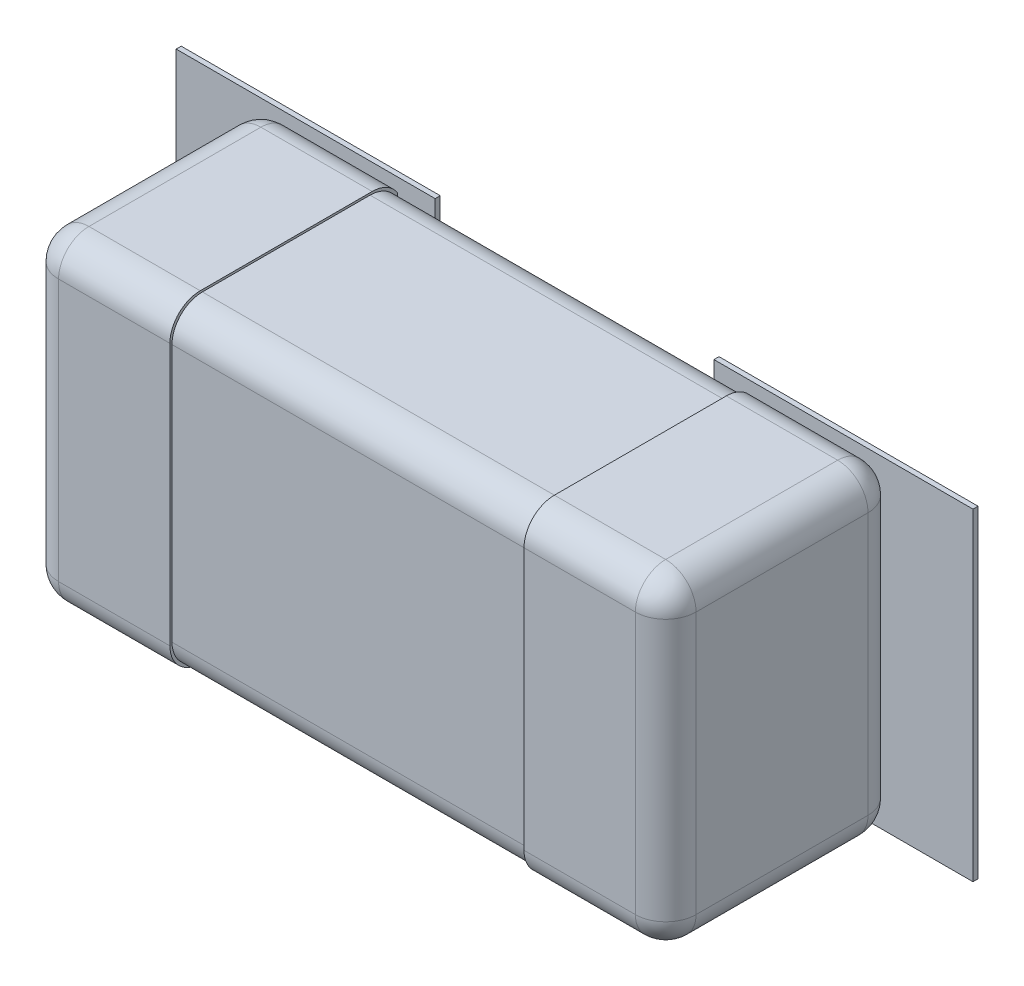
ISO-10303-21;
HEADER;
FILE_DESCRIPTION(('STEP AP214'),'2;1');
FILE_NAME('part.step','',(''),(''),'','','');
FILE_SCHEMA(('AUTOMOTIVE_DESIGN { 1 0 10303 214 1 1 1 1 }'));
ENDSEC;
DATA;
#1=APPLICATION_CONTEXT('core data for automotive mechanical design processes');
#2=APPLICATION_PROTOCOL_DEFINITION('international standard','automotive_design',2000,#1);
#3=PRODUCT_CONTEXT('',#1,'mechanical');
#4=PRODUCT('Part','Part','',(#3));
#5=PRODUCT_RELATED_PRODUCT_CATEGORY('part','',(#4));
#6=PRODUCT_DEFINITION_FORMATION('','',#4);
#7=PRODUCT_DEFINITION_CONTEXT('part definition',#1,'design');
#8=PRODUCT_DEFINITION('design','',#6,#7);
#9=PRODUCT_DEFINITION_SHAPE('','',#8);
#10=(LENGTH_UNIT() NAMED_UNIT(*) SI_UNIT(.MILLI.,.METRE.));
#11=(NAMED_UNIT(*) PLANE_ANGLE_UNIT() SI_UNIT($,.RADIAN.));
#12=(NAMED_UNIT(*) SI_UNIT($,.STERADIAN.) SOLID_ANGLE_UNIT());
#13=UNCERTAINTY_MEASURE_WITH_UNIT(LENGTH_MEASURE(1.E-05),#10,'distance_accuracy_value','');
#14=(GEOMETRIC_REPRESENTATION_CONTEXT(3) GLOBAL_UNCERTAINTY_ASSIGNED_CONTEXT((#13)) GLOBAL_UNIT_ASSIGNED_CONTEXT((#10,
#11,#12)) REPRESENTATION_CONTEXT('',''));
#15=CARTESIAN_POINT('',(0.,0.,0.));
#16=DIRECTION('',(0.,0.,1.));
#17=DIRECTION('',(1.,0.,0.));
#18=AXIS2_PLACEMENT_3D('',#15,#16,#17);
#19=CARTESIAN_POINT('',(-0.800000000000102,0.404999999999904,0.0762));
#20=DIRECTION('',(-1.,0.,0.));
#21=DIRECTION('',(0.,0.,1.));
#22=AXIS2_PLACEMENT_3D('',#19,#20,#21);
#23=PLANE('',#22);
#24=DIRECTION('',(0.,0.,-1.));
#25=VECTOR('',#24,1.);
#26=CARTESIAN_POINT('',(-0.800000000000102,0.328799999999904,1.4213780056));
#27=LINE('',#26,#25);
#28=CARTESIAN_POINT('',(-0.800000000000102,0.328799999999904,0.1524));
#29=VERTEX_POINT('',#28);
#30=CARTESIAN_POINT('',(-0.800000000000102,0.328799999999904,0.583946));
#31=VERTEX_POINT('',#30);
#32=EDGE_CURVE('E163',#29,#31,#27,.F.);
#33=ORIENTED_EDGE('',*,*,#32,.F.);
#34=DIRECTION('',(0.,1.,0.));
#35=VECTOR('',#34,1.);
#36=CARTESIAN_POINT('',(-0.800000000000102,-1.4609268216,0.1524));
#37=LINE('',#36,#35);
#38=CARTESIAN_POINT('',(-0.800000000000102,-0.328799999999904,0.1524));
#39=VERTEX_POINT('',#38);
#40=EDGE_CURVE('E168',#39,#29,#37,.T.);
#41=ORIENTED_EDGE('',*,*,#40,.F.);
#42=DIRECTION('',(0.,0.,-1.));
#43=VECTOR('',#42,1.);
#44=CARTESIAN_POINT('',(-0.800000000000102,-0.328799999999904,1.4213780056));
#45=LINE('',#44,#43);
#46=CARTESIAN_POINT('',(-0.800000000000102,-0.328799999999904,0.583946));
#47=VERTEX_POINT('',#46);
#48=EDGE_CURVE('E68',#47,#39,#45,.T.);
#49=ORIENTED_EDGE('',*,*,#48,.F.);
#50=DIRECTION('',(0.,-1.,0.));
#51=VECTOR('',#50,1.);
#52=CARTESIAN_POINT('',(-0.800000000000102,1.4609268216,0.583946));
#53=LINE('',#52,#51);
#54=EDGE_CURVE('E87',#31,#47,#53,.T.);
#55=ORIENTED_EDGE('',*,*,#54,.F.);
#56=EDGE_LOOP('',(#33,#41,#49,#55));
#57=FACE_BOUND('',#56,.T.);
#58=ADVANCED_FACE('F16',(#57),#23,.T.);
#59=CARTESIAN_POINT('',(0.,0.,0.0762));
#60=DIRECTION('',(0.,0.,1.));
#61=DIRECTION('',(1.,0.,0.));
#62=AXIS2_PLACEMENT_3D('',#59,#60,#61);
#63=PLANE('',#62);
#64=DIRECTION('',(1.,0.,0.));
#65=VECTOR('',#64,1.);
#66=CARTESIAN_POINT('',(-0.999871,-0.405003,0.0762));
#67=LINE('',#66,#65);
#68=CARTESIAN_POINT('',(-0.999871,-0.405003,0.0762));
#69=VERTEX_POINT('',#68);
#70=CARTESIAN_POINT('',(-0.349885,-0.405003,0.0762));
#71=VERTEX_POINT('',#70);
#72=EDGE_CURVE('E152',#69,#71,#67,.T.);
#73=ORIENTED_EDGE('',*,*,#72,.F.);
#74=DIRECTION('',(0.,1.,0.));
#75=VECTOR('',#74,1.);
#76=CARTESIAN_POINT('',(-0.999871,0.405003,0.0762));
#77=LINE('',#76,#75);
#78=CARTESIAN_POINT('',(-0.999871,0.405003,0.0762));
#79=VERTEX_POINT('',#78);
#80=EDGE_CURVE('E158',#79,#69,#77,.F.);
#81=ORIENTED_EDGE('',*,*,#80,.F.);
#82=DIRECTION('',(1.,0.,0.));
#83=VECTOR('',#82,1.);
#84=CARTESIAN_POINT('',(-0.349885,0.405003,0.0762));
#85=LINE('',#84,#83);
#86=CARTESIAN_POINT('',(-0.349885,0.405003,0.0762));
#87=VERTEX_POINT('',#86);
#88=EDGE_CURVE('E138',#87,#79,#85,.F.);
#89=ORIENTED_EDGE('',*,*,#88,.F.);
#90=DIRECTION('',(0.,1.,0.));
#91=VECTOR('',#90,1.);
#92=CARTESIAN_POINT('',(-0.349885,-0.405003,0.0762));
#93=LINE('',#92,#91);
#94=EDGE_CURVE('E145',#71,#87,#93,.T.);
#95=ORIENTED_EDGE('',*,*,#94,.F.);
#96=EDGE_LOOP('',(#73,#81,#89,#95));
#97=FACE_BOUND('',#96,.T.);
#98=ADVANCED_FACE('F371',(#97),#63,.F.);
#99=CARTESIAN_POINT('',(0.,0.,0.0762));
#100=DIRECTION('',(0.,0.,1.));
#101=DIRECTION('',(1.,0.,0.));
#102=AXIS2_PLACEMENT_3D('',#99,#100,#101);
#103=PLANE('',#102);
#104=DIRECTION('',(1.,0.,0.));
#105=VECTOR('',#104,1.);
#106=CARTESIAN_POINT('',(0.349885,-0.405003,0.0762));
#107=LINE('',#106,#105);
#108=CARTESIAN_POINT('',(0.349885,-0.405003,0.0762));
#109=VERTEX_POINT('',#108);
#110=CARTESIAN_POINT('',(0.999871,-0.405003,0.0762));
#111=VERTEX_POINT('',#110);
#112=EDGE_CURVE('E113',#109,#111,#107,.T.);
#113=ORIENTED_EDGE('',*,*,#112,.F.);
#114=DIRECTION('',(0.,1.,0.));
#115=VECTOR('',#114,1.);
#116=CARTESIAN_POINT('',(0.349885,0.405003,0.0762));
#117=LINE('',#116,#115);
#118=CARTESIAN_POINT('',(0.349885,0.405003,0.0762));
#119=VERTEX_POINT('',#118);
#120=EDGE_CURVE('E120',#119,#109,#117,.F.);
#121=ORIENTED_EDGE('',*,*,#120,.F.);
#122=DIRECTION('',(1.,0.,0.));
#123=VECTOR('',#122,1.);
#124=CARTESIAN_POINT('',(0.999871,0.405003,0.0762));
#125=LINE('',#124,#123);
#126=CARTESIAN_POINT('',(0.999871,0.405003,0.0762));
#127=VERTEX_POINT('',#126);
#128=EDGE_CURVE('E127',#127,#119,#125,.F.);
#129=ORIENTED_EDGE('',*,*,#128,.F.);
#130=DIRECTION('',(0.,1.,0.));
#131=VECTOR('',#130,1.);
#132=CARTESIAN_POINT('',(0.999871,-0.405003,0.0762));
#133=LINE('',#132,#131);
#134=EDGE_CURVE('E133',#111,#127,#133,.T.);
#135=ORIENTED_EDGE('',*,*,#134,.F.);
#136=EDGE_LOOP('',(#113,#121,#129,#135));
#137=FACE_BOUND('',#136,.T.);
#138=ADVANCED_FACE('F368',(#137),#103,.F.);
#139=CARTESIAN_POINT('',(0.800000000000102,-0.404999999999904,0.0762));
#140=DIRECTION('',(1.,0.,0.));
#141=DIRECTION('',(0.,0.,-1.));
#142=AXIS2_PLACEMENT_3D('',#139,#140,#141);
#143=PLANE('',#142);
#144=DIRECTION('',(0.,0.,-1.));
#145=VECTOR('',#144,1.);
#146=CARTESIAN_POINT('',(0.800000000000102,0.328799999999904,1.4213780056));
#147=LINE('',#146,#145);
#148=CARTESIAN_POINT('',(0.800000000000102,0.328799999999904,0.583946));
#149=VERTEX_POINT('',#148);
#150=CARTESIAN_POINT('',(0.800000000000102,0.328799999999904,0.1524));
#151=VERTEX_POINT('',#150);
#152=EDGE_CURVE('E109',#149,#151,#147,.T.);
#153=ORIENTED_EDGE('',*,*,#152,.F.);
#154=DIRECTION('',(0.,1.,0.));
#155=VECTOR('',#154,1.);
#156=CARTESIAN_POINT('',(0.800000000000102,-1.4609268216,0.583946));
#157=LINE('',#156,#155);
#158=CARTESIAN_POINT('',(0.800000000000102,-0.328799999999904,0.583946));
#159=VERTEX_POINT('',#158);
#160=EDGE_CURVE('E104',#159,#149,#157,.T.);
#161=ORIENTED_EDGE('',*,*,#160,.F.);
#162=DIRECTION('',(0.,0.,-1.));
#163=VECTOR('',#162,1.);
#164=CARTESIAN_POINT('',(0.800000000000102,-0.328799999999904,1.4213780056));
#165=LINE('',#164,#163);
#166=CARTESIAN_POINT('',(0.800000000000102,-0.328799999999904,0.1524));
#167=VERTEX_POINT('',#166);
#168=EDGE_CURVE('E94',#167,#159,#165,.F.);
#169=ORIENTED_EDGE('',*,*,#168,.F.);
#170=DIRECTION('',(0.,-1.,0.));
#171=VECTOR('',#170,1.);
#172=CARTESIAN_POINT('',(0.800000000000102,1.4609268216,0.1524));
#173=LINE('',#172,#171);
#174=EDGE_CURVE('E99',#151,#167,#173,.T.);
#175=ORIENTED_EDGE('',*,*,#174,.F.);
#176=EDGE_LOOP('',(#153,#161,#169,#175));
#177=FACE_BOUND('',#176,.T.);
#178=ADVANCED_FACE('F365',(#177),#143,.T.);
#179=CARTESIAN_POINT('',(-0.723800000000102,-0.328799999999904,1.4213780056));
#180=DIRECTION('',(0.,0.,-1.));
#181=DIRECTION('',(-1.,0.,0.));
#182=AXIS2_PLACEMENT_3D('',#179,#180,#181);
#183=CYLINDRICAL_SURFACE('',#182,0.0762);
#184=CARTESIAN_POINT('',(-0.723800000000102,-0.328799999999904,0.1524));
#185=DIRECTION('',(0.,0.,-1.));
#186=DIRECTION('',(-1.,0.,0.));
#187=AXIS2_PLACEMENT_3D('',#184,#185,#186);
#188=CIRCLE('',#187,0.0762);
#189=CARTESIAN_POINT('',(-0.723800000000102,-0.404999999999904,0.1524));
#190=VERTEX_POINT('',#189);
#191=EDGE_CURVE('E166',#190,#39,#188,.T.);
#192=ORIENTED_EDGE('',*,*,#191,.F.);
#193=DIRECTION('',(0.,0.,-1.));
#194=VECTOR('',#193,1.);
#195=CARTESIAN_POINT('',(-0.723800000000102,-0.404999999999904,0.0762));
#196=LINE('',#195,#194);
#197=CARTESIAN_POINT('',(-0.723800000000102,-0.404999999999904,0.583945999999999));
#198=VERTEX_POINT('',#197);
#199=EDGE_CURVE('E85',#198,#190,#196,.T.);
#200=ORIENTED_EDGE('',*,*,#199,.F.);
#201=CARTESIAN_POINT('',(-0.723800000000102,-0.328799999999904,0.583946));
#202=DIRECTION('',(0.,0.,1.));
#203=DIRECTION('',(-0.707106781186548,-0.707106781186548,0.));
#204=AXIS2_PLACEMENT_3D('',#201,#202,#203);
#205=CIRCLE('',#204,0.0762);
#206=CARTESIAN_POINT('',(-0.777681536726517,-0.382681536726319,0.583946));
#207=VERTEX_POINT('',#206);
#208=EDGE_CURVE('E78',#207,#198,#205,.T.);
#209=ORIENTED_EDGE('',*,*,#208,.F.);
#210=CARTESIAN_POINT('',(-0.723800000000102,-0.328799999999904,0.583946));
#211=DIRECTION('',(0.,0.,-1.));
#212=DIRECTION('',(-1.,0.,0.));
#213=AXIS2_PLACEMENT_3D('',#210,#211,#212);
#214=CIRCLE('',#213,0.0762);
#215=EDGE_CURVE('E19',#47,#207,#214,.F.);
#216=ORIENTED_EDGE('',*,*,#215,.F.);
#217=ORIENTED_EDGE('',*,*,#48,.T.);
#218=EDGE_LOOP('',(#192,#200,#209,#216,#217));
#219=FACE_BOUND('',#218,.T.);
#220=ADVANCED_FACE('F83',(#219),#183,.T.);
#221=CARTESIAN_POINT('',(-0.723800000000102,-0.328799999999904,0.583946));
#222=DIRECTION('',(-0.707106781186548,-0.707106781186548,0.));
#223=DIRECTION('',(0.,0.,1.));
#224=AXIS2_PLACEMENT_3D('',#221,#222,#223);
#225=SPHERICAL_SURFACE('',#224,0.0762);
#226=ORIENTED_EDGE('',*,*,#215,.T.);
#227=ORIENTED_EDGE('',*,*,#208,.T.);
#228=CARTESIAN_POINT('',(-0.723800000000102,-0.328799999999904,0.583946));
#229=DIRECTION('',(1.,0.,0.));
#230=DIRECTION('',(0.,0.,-1.));
#231=AXIS2_PLACEMENT_3D('',#228,#229,#230);
#232=CIRCLE('',#231,0.0762);
#233=CARTESIAN_POINT('',(-0.723800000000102,-0.328799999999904,0.660146));
#234=VERTEX_POINT('',#233);
#235=EDGE_CURVE('E549',#234,#198,#232,.T.);
#236=ORIENTED_EDGE('',*,*,#235,.F.);
#237=CARTESIAN_POINT('',(-0.723800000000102,-0.328799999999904,0.583946));
#238=DIRECTION('',(0.,-1.,0.));
#239=DIRECTION('',(0.,0.,-1.));
#240=AXIS2_PLACEMENT_3D('',#237,#238,#239);
#241=CIRCLE('',#240,0.0762);
#242=EDGE_CURVE('E80',#47,#234,#241,.F.);
#243=ORIENTED_EDGE('',*,*,#242,.F.);
#244=EDGE_LOOP('',(#226,#227,#236,#243));
#245=FACE_BOUND('',#244,.T.);
#246=ADVANCED_FACE('F76',(#245),#225,.T.);
#247=CARTESIAN_POINT('',(-0.723800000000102,1.4609268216,0.583946));
#248=DIRECTION('',(0.,-1.,0.));
#249=DIRECTION('',(0.,0.,-1.));
#250=AXIS2_PLACEMENT_3D('',#247,#248,#249);
#251=CYLINDRICAL_SURFACE('',#250,0.0762);
#252=ORIENTED_EDGE('',*,*,#242,.T.);
#253=DIRECTION('',(0.,1.,0.));
#254=VECTOR('',#253,1.);
#255=CARTESIAN_POINT('',(-0.723800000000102,0.,0.660146));
#256=LINE('',#255,#254);
#257=CARTESIAN_POINT('',(-0.723800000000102,0.328799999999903,0.660146));
#258=VERTEX_POINT('',#257);
#259=EDGE_CURVE('E345',#258,#234,#256,.F.);
#260=ORIENTED_EDGE('',*,*,#259,.F.);
#261=CARTESIAN_POINT('',(-0.723800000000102,0.328799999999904,0.583946));
#262=DIRECTION('',(0.,1.,0.));
#263=DIRECTION('',(-0.707106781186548,0.,0.707106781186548));
#264=AXIS2_PLACEMENT_3D('',#261,#262,#263);
#265=CIRCLE('',#264,0.0762);
#266=CARTESIAN_POINT('',(-0.777681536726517,0.328799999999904,0.637827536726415));
#267=VERTEX_POINT('',#266);
#268=EDGE_CURVE('E352',#267,#258,#265,.T.);
#269=ORIENTED_EDGE('',*,*,#268,.F.);
#270=CARTESIAN_POINT('',(-0.723800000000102,0.328799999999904,0.583946));
#271=DIRECTION('',(0.,-1.,0.));
#272=DIRECTION('',(0.,0.,-1.));
#273=AXIS2_PLACEMENT_3D('',#270,#271,#272);
#274=CIRCLE('',#273,0.0762);
#275=EDGE_CURVE('E662',#31,#267,#274,.F.);
#276=ORIENTED_EDGE('',*,*,#275,.F.);
#277=ORIENTED_EDGE('',*,*,#54,.T.);
#278=EDGE_LOOP('',(#252,#260,#269,#276,#277));
#279=FACE_BOUND('',#278,.T.);
#280=ADVANCED_FACE('F356',(#279),#251,.T.);
#281=CARTESIAN_POINT('',(-0.723800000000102,0.328799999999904,0.583946));
#282=DIRECTION('',(-0.707106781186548,0.,0.707106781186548));
#283=DIRECTION('',(0.,1.,0.));
#284=AXIS2_PLACEMENT_3D('',#281,#282,#283);
#285=SPHERICAL_SURFACE('',#284,0.0762);
#286=ORIENTED_EDGE('',*,*,#275,.T.);
#287=ORIENTED_EDGE('',*,*,#268,.T.);
#288=CARTESIAN_POINT('',(-0.723800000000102,0.328799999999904,0.583946));
#289=DIRECTION('',(-1.,0.,0.));
#290=DIRECTION('',(0.,0.,1.));
#291=AXIS2_PLACEMENT_3D('',#288,#289,#290);
#292=CIRCLE('',#291,0.0762);
#293=CARTESIAN_POINT('',(-0.723800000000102,0.404999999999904,0.583946));
#294=VERTEX_POINT('',#293);
#295=EDGE_CURVE('E544',#294,#258,#292,.F.);
#296=ORIENTED_EDGE('',*,*,#295,.F.);
#297=CARTESIAN_POINT('',(-0.723800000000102,0.328799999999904,0.583946));
#298=DIRECTION('',(0.,0.,-1.));
#299=DIRECTION('',(-1.,0.,0.));
#300=AXIS2_PLACEMENT_3D('',#297,#298,#299);
#301=CIRCLE('',#300,0.0762);
#302=EDGE_CURVE('E167',#31,#294,#301,.T.);
#303=ORIENTED_EDGE('',*,*,#302,.F.);
#304=EDGE_LOOP('',(#286,#287,#296,#303));
#305=FACE_BOUND('',#304,.T.);
#306=ADVANCED_FACE('F353',(#305),#285,.T.);
#307=CARTESIAN_POINT('',(-0.723800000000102,0.328799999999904,1.4213780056));
#308=DIRECTION('',(0.,0.,-1.));
#309=DIRECTION('',(-1.,0.,0.));
#310=AXIS2_PLACEMENT_3D('',#307,#308,#309);
#311=CYLINDRICAL_SURFACE('',#310,0.0762);
#312=CARTESIAN_POINT('',(-0.723800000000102,0.328799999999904,0.1524));
#313=DIRECTION('',(0.,0.,-1.));
#314=DIRECTION('',(-1.,0.,0.));
#315=AXIS2_PLACEMENT_3D('',#312,#313,#314);
#316=CIRCLE('',#315,0.0762);
#317=CARTESIAN_POINT('',(-0.777681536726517,0.382681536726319,0.1524));
#318=VERTEX_POINT('',#317);
#319=EDGE_CURVE('E645',#29,#318,#316,.T.);
#320=ORIENTED_EDGE('',*,*,#319,.F.);
#321=ORIENTED_EDGE('',*,*,#32,.T.);
#322=ORIENTED_EDGE('',*,*,#302,.T.);
#323=DIRECTION('',(0.,0.,1.));
#324=VECTOR('',#323,1.);
#325=CARTESIAN_POINT('',(-0.723800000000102,0.404999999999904,0.0762));
#326=LINE('',#325,#324);
#327=CARTESIAN_POINT('',(-0.723800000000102,0.404999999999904,0.1524));
#328=VERTEX_POINT('',#327);
#329=EDGE_CURVE('E340',#328,#294,#326,.T.);
#330=ORIENTED_EDGE('',*,*,#329,.F.);
#331=CARTESIAN_POINT('',(-0.723800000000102,0.328799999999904,0.1524));
#332=DIRECTION('',(0.,0.,-1.));
#333=DIRECTION('',(-0.707106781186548,0.707106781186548,0.));
#334=AXIS2_PLACEMENT_3D('',#331,#332,#333);
#335=CIRCLE('',#334,0.0762);
#336=EDGE_CURVE('E142',#318,#328,#335,.T.);
#337=ORIENTED_EDGE('',*,*,#336,.F.);
#338=EDGE_LOOP('',(#320,#321,#322,#330,#337));
#339=FACE_BOUND('',#338,.T.);
#340=ADVANCED_FACE('F333',(#339),#311,.T.);
#341=CARTESIAN_POINT('',(-0.723800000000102,-0.328799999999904,0.1524));
#342=DIRECTION('',(-0.707106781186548,0.,-0.707106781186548));
#343=DIRECTION('',(0.,-1.,0.));
#344=AXIS2_PLACEMENT_3D('',#341,#342,#343);
#345=SPHERICAL_SURFACE('',#344,0.0762);
#346=CARTESIAN_POINT('',(-0.723800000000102,-0.328799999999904,0.1524));
#347=DIRECTION('',(0.,1.,0.));
#348=DIRECTION('',(0.,0.,1.));
#349=AXIS2_PLACEMENT_3D('',#346,#347,#348);
#350=CIRCLE('',#349,0.0762);
#351=CARTESIAN_POINT('',(-0.765921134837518,-0.328799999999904,0.0889));
#352=VERTEX_POINT('',#351);
#353=CARTESIAN_POINT('',(-0.777681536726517,-0.328799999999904,0.0985184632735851));
#354=VERTEX_POINT('',#353);
#355=EDGE_CURVE('E34',#352,#354,#350,.T.);
#356=ORIENTED_EDGE('',*,*,#355,.F.);
#357=CARTESIAN_POINT('',(-0.723800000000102,-0.370921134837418,0.0888999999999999));
#358=CARTESIAN_POINT('',(-0.728547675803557,-0.370952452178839,0.0889000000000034));
#359=CARTESIAN_POINT('',(-0.733275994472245,-0.37012301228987,0.0889000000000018));
#360=CARTESIAN_POINT('',(-0.742208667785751,-0.366970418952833,0.0888999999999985));
#361=CARTESIAN_POINT('',(-0.746413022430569,-0.364647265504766,0.0888999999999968));
#362=CARTESIAN_POINT('',(-0.753812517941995,-0.358735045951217,0.0889000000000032));
#363=CARTESIAN_POINT('',(-0.757007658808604,-0.355145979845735,0.0889000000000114));
#364=CARTESIAN_POINT('',(-0.762025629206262,-0.347108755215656,0.0889000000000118));
#365=CARTESIAN_POINT('',(-0.76384845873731,-0.342660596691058,0.088900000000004));
#366=CARTESIAN_POINT('',(-0.765581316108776,-0.335011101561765,0.0888999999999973));
#367=CARTESIAN_POINT('',(-0.76593245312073,-0.33190399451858,0.0888999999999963));
#368=CARTESIAN_POINT('',(-0.765921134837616,-0.328799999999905,0.0889000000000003));
#369=B_SPLINE_CURVE_WITH_KNOTS('',3,(#357,#358,#359,#360,#361,#362,#363,#364,#365,#366,#367,
#368),.UNSPECIFIED.,.F.,.F.,(4,2,2,2,2,4),(0.,0.0141430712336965,0.0282861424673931,
0.0424292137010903,0.0565722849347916,0.0658755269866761),.UNSPECIFIED.);
#370=CARTESIAN_POINT('',(-0.723800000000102,-0.370921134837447,0.0889));
#371=VERTEX_POINT('',#370);
#372=EDGE_CURVE('E315',#371,#352,#369,.T.);
#373=ORIENTED_EDGE('',*,*,#372,.F.);
#374=CARTESIAN_POINT('',(-0.723800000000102,-0.328799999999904,0.1524));
#375=DIRECTION('',(-1.,0.,0.));
#376=DIRECTION('',(0.,0.,1.));
#377=AXIS2_PLACEMENT_3D('',#374,#375,#376);
#378=CIRCLE('',#377,0.0762);
#379=EDGE_CURVE('E559',#190,#371,#378,.F.);
#380=ORIENTED_EDGE('',*,*,#379,.F.);
#381=ORIENTED_EDGE('',*,*,#191,.T.);
#382=CARTESIAN_POINT('',(-0.723800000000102,-0.328799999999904,0.1524));
#383=DIRECTION('',(0.,1.,0.));
#384=DIRECTION('',(0.,0.,1.));
#385=AXIS2_PLACEMENT_3D('',#382,#383,#384);
#386=CIRCLE('',#385,0.0762);
#387=EDGE_CURVE('E172',#354,#39,#386,.T.);
#388=ORIENTED_EDGE('',*,*,#387,.F.);
#389=EDGE_LOOP('',(#356,#373,#380,#381,#388));
#390=FACE_BOUND('',#389,.T.);
#391=ADVANCED_FACE('F326',(#390),#345,.T.);
#392=CARTESIAN_POINT('',(-0.723800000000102,-1.4609268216,0.1524));
#393=DIRECTION('',(0.,1.,0.));
#394=DIRECTION('',(0.,0.,1.));
#395=AXIS2_PLACEMENT_3D('',#392,#393,#394);
#396=CYLINDRICAL_SURFACE('',#395,0.0762);
#397=CARTESIAN_POINT('',(-0.723800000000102,0.328799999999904,0.1524));
#398=DIRECTION('',(0.,1.,0.));
#399=DIRECTION('',(0.,0.,1.));
#400=AXIS2_PLACEMENT_3D('',#397,#398,#399);
#401=CIRCLE('',#400,0.0762);
#402=CARTESIAN_POINT('',(-0.765921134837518,0.328799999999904,0.0889));
#403=VERTEX_POINT('',#402);
#404=EDGE_CURVE('E171',#403,#29,#401,.T.);
#405=ORIENTED_EDGE('',*,*,#404,.F.);
#406=DIRECTION('',(0.,1.,0.));
#407=VECTOR('',#406,1.);
#408=CARTESIAN_POINT('',(-0.76592113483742,0.,0.0889));
#409=LINE('',#408,#407);
#410=EDGE_CURVE('E322',#352,#403,#409,.T.);
#411=ORIENTED_EDGE('',*,*,#410,.F.);
#412=ORIENTED_EDGE('',*,*,#355,.T.);
#413=ORIENTED_EDGE('',*,*,#387,.T.);
#414=ORIENTED_EDGE('',*,*,#40,.T.);
#415=EDGE_LOOP('',(#405,#411,#412,#413,#414));
#416=FACE_BOUND('',#415,.T.);
#417=ADVANCED_FACE('F332',(#416),#396,.T.);
#418=CARTESIAN_POINT('',(-0.723800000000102,0.328799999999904,0.1524));
#419=DIRECTION('',(-0.707106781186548,0.707106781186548,0.));
#420=DIRECTION('',(0.,0.,-1.));
#421=AXIS2_PLACEMENT_3D('',#418,#419,#420);
#422=SPHERICAL_SURFACE('',#421,0.0762);
#423=CARTESIAN_POINT('',(-0.723800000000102,0.328799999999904,0.1524));
#424=DIRECTION('',(1.,0.,0.));
#425=DIRECTION('',(0.,0.,-1.));
#426=AXIS2_PLACEMENT_3D('',#423,#424,#425);
#427=CIRCLE('',#426,0.0762);
#428=CARTESIAN_POINT('',(-0.723800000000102,0.370921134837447,0.0889));
#429=VERTEX_POINT('',#428);
#430=EDGE_CURVE('E324',#429,#328,#427,.T.);
#431=ORIENTED_EDGE('',*,*,#430,.F.);
#432=CARTESIAN_POINT('',(-0.765921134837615,0.328799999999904,0.0889));
#433=CARTESIAN_POINT('',(-0.765952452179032,0.333547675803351,0.0888999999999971));
#434=CARTESIAN_POINT('',(-0.765123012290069,0.338275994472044,0.0889000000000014));
#435=CARTESIAN_POINT('',(-0.76197041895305,0.347208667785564,0.0889000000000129));
#436=CARTESIAN_POINT('',(-0.759647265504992,0.35141302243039,0.0889000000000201));
#437=CARTESIAN_POINT('',(-0.753735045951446,0.358812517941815,0.088900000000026));
#438=CARTESIAN_POINT('',(-0.750145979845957,0.362007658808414,0.0889000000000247));
#439=CARTESIAN_POINT('',(-0.742108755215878,0.367025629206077,0.0889000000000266));
#440=CARTESIAN_POINT('',(-0.737660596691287,0.368848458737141,0.0889000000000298));
#441=CARTESIAN_POINT('',(-0.730011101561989,0.37058131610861,0.088900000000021));
#442=CARTESIAN_POINT('',(-0.726903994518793,0.370932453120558,0.0889000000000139));
#443=CARTESIAN_POINT('',(-0.723800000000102,0.370921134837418,0.0889));
#444=B_SPLINE_CURVE_WITH_KNOTS('',3,(#432,#433,#434,#435,#436,#437,#438,#439,#440,#441,#442,
#443),.UNSPECIFIED.,.F.,.F.,(4,2,2,2,2,4),(0.,0.0141430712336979,0.0282861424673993,
0.0424292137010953,0.0565722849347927,0.0658755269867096),.UNSPECIFIED.);
#445=EDGE_CURVE('E308',#403,#429,#444,.T.);
#446=ORIENTED_EDGE('',*,*,#445,.F.);
#447=ORIENTED_EDGE('',*,*,#404,.T.);
#448=ORIENTED_EDGE('',*,*,#319,.T.);
#449=ORIENTED_EDGE('',*,*,#336,.T.);
#450=EDGE_LOOP('',(#431,#446,#447,#448,#449));
#451=FACE_BOUND('',#450,.T.);
#452=ADVANCED_FACE('F634',(#451),#422,.T.);
#453=CARTESIAN_POINT('',(-0.349885,0.405003,0.0762));
#454=DIRECTION('',(0.,1.,0.));
#455=DIRECTION('',(0.,0.,1.));
#456=AXIS2_PLACEMENT_3D('',#453,#454,#455);
#457=PLANE('',#456);
#458=DIRECTION('',(0.,0.,-1.));
#459=VECTOR('',#458,1.);
#460=CARTESIAN_POINT('',(-0.349885,0.405003,0.0762));
#461=LINE('',#460,#459);
#462=CARTESIAN_POINT('',(-0.349885,0.405003,0.0889));
#463=VERTEX_POINT('',#462);
#464=EDGE_CURVE('E148',#87,#463,#461,.F.);
#465=ORIENTED_EDGE('',*,*,#464,.F.);
#466=ORIENTED_EDGE('',*,*,#88,.T.);
#467=DIRECTION('',(0.,0.,1.));
#468=VECTOR('',#467,1.);
#469=CARTESIAN_POINT('',(-0.999871,0.405003,0.0762));
#470=LINE('',#469,#468);
#471=CARTESIAN_POINT('',(-0.999871,0.405003,0.0889));
#472=VERTEX_POINT('',#471);
#473=EDGE_CURVE('E141',#472,#79,#470,.F.);
#474=ORIENTED_EDGE('',*,*,#473,.F.);
#475=DIRECTION('',(1.,0.,0.));
#476=VECTOR('',#475,1.);
#477=CARTESIAN_POINT('',(0.,0.405003,0.0889));
#478=LINE('',#477,#476);
#479=EDGE_CURVE('E878',#463,#472,#478,.F.);
#480=ORIENTED_EDGE('',*,*,#479,.F.);
#481=EDGE_LOOP('',(#465,#466,#474,#480));
#482=FACE_BOUND('',#481,.T.);
#483=ADVANCED_FACE('F631',(#482),#457,.T.);
#484=CARTESIAN_POINT('',(-0.999871,0.405003,0.0762));
#485=DIRECTION('',(-1.,0.,0.));
#486=DIRECTION('',(0.,0.,1.));
#487=AXIS2_PLACEMENT_3D('',#484,#485,#486);
#488=PLANE('',#487);
#489=ORIENTED_EDGE('',*,*,#473,.T.);
#490=ORIENTED_EDGE('',*,*,#80,.T.);
#491=DIRECTION('',(0.,0.,-1.));
#492=VECTOR('',#491,1.);
#493=CARTESIAN_POINT('',(-0.999871,-0.405003,0.0762));
#494=LINE('',#493,#492);
#495=CARTESIAN_POINT('',(-0.999871,-0.405003,0.0889));
#496=VERTEX_POINT('',#495);
#497=EDGE_CURVE('E155',#496,#69,#494,.T.);
#498=ORIENTED_EDGE('',*,*,#497,.F.);
#499=DIRECTION('',(0.,1.,0.));
#500=VECTOR('',#499,1.);
#501=CARTESIAN_POINT('',(-0.999871,0.,0.0889));
#502=LINE('',#501,#500);
#503=EDGE_CURVE('E886',#472,#496,#502,.F.);
#504=ORIENTED_EDGE('',*,*,#503,.F.);
#505=EDGE_LOOP('',(#489,#490,#498,#504));
#506=FACE_BOUND('',#505,.T.);
#507=ADVANCED_FACE('F627',(#506),#488,.T.);
#508=CARTESIAN_POINT('',(-0.999871,-0.405003,0.0762));
#509=DIRECTION('',(0.,-1.,0.));
#510=DIRECTION('',(0.,0.,-1.));
#511=AXIS2_PLACEMENT_3D('',#508,#509,#510);
#512=PLANE('',#511);
#513=ORIENTED_EDGE('',*,*,#497,.T.);
#514=ORIENTED_EDGE('',*,*,#72,.T.);
#515=DIRECTION('',(0.,0.,-1.));
#516=VECTOR('',#515,1.);
#517=CARTESIAN_POINT('',(-0.349885,-0.405003,0.0762));
#518=LINE('',#517,#516);
#519=CARTESIAN_POINT('',(-0.349885,-0.405003,0.0889));
#520=VERTEX_POINT('',#519);
#521=EDGE_CURVE('E149',#520,#71,#518,.T.);
#522=ORIENTED_EDGE('',*,*,#521,.F.);
#523=DIRECTION('',(1.,0.,0.));
#524=VECTOR('',#523,1.);
#525=CARTESIAN_POINT('',(0.,-0.405003,0.0889));
#526=LINE('',#525,#524);
#527=EDGE_CURVE('E888',#496,#520,#526,.T.);
#528=ORIENTED_EDGE('',*,*,#527,.F.);
#529=EDGE_LOOP('',(#513,#514,#522,#528));
#530=FACE_BOUND('',#529,.T.);
#531=ADVANCED_FACE('F623',(#530),#512,.T.);
#532=CARTESIAN_POINT('',(-0.444400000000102,-0.404999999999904,0.081534));
#533=DIRECTION('',(0.,0.,1.));
#534=DIRECTION('',(1.,0.,0.));
#535=AXIS2_PLACEMENT_3D('',#532,#533,#534);
#536=PLANE('',#535);
#537=DIRECTION('',(0.,1.,0.));
#538=VECTOR('',#537,1.);
#539=CARTESIAN_POINT('',(0.349885,0.405003,0.081534));
#540=LINE('',#539,#538);
#541=CARTESIAN_POINT('',(0.349885,-0.323465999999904,0.081534));
#542=VERTEX_POINT('',#541);
#543=CARTESIAN_POINT('',(0.349885,0.323465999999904,0.081534));
#544=VERTEX_POINT('',#543);
#545=EDGE_CURVE('E103',#542,#544,#540,.T.);
#546=ORIENTED_EDGE('',*,*,#545,.F.);
#547=DIRECTION('',(1.,0.,0.));
#548=VECTOR('',#547,1.);
#549=CARTESIAN_POINT('',(-3.6067346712,-0.323465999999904,0.081534));
#550=LINE('',#549,#548);
#551=CARTESIAN_POINT('',(-0.349885,-0.323465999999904,0.081534));
#552=VERTEX_POINT('',#551);
#553=EDGE_CURVE('E906',#552,#542,#550,.T.);
#554=ORIENTED_EDGE('',*,*,#553,.F.);
#555=DIRECTION('',(0.,1.,0.));
#556=VECTOR('',#555,1.);
#557=CARTESIAN_POINT('',(-0.349885,-0.405003,0.081534));
#558=LINE('',#557,#556);
#559=CARTESIAN_POINT('',(-0.349885,0.323465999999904,0.081534));
#560=VERTEX_POINT('',#559);
#561=EDGE_CURVE('E117',#560,#552,#558,.F.);
#562=ORIENTED_EDGE('',*,*,#561,.F.);
#563=DIRECTION('',(-1.,0.,0.));
#564=VECTOR('',#563,1.);
#565=CARTESIAN_POINT('',(3.6067346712,0.323465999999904,0.081534));
#566=LINE('',#565,#564);
#567=EDGE_CURVE('E900',#544,#560,#566,.T.);
#568=ORIENTED_EDGE('',*,*,#567,.F.);
#569=EDGE_LOOP('',(#546,#554,#562,#568));
#570=FACE_BOUND('',#569,.T.);
#571=ADVANCED_FACE('F619',(#570),#536,.F.);
#572=CARTESIAN_POINT('',(-0.349885,-0.405003,0.0762));
#573=DIRECTION('',(1.,0.,0.));
#574=DIRECTION('',(0.,0.,-1.));
#575=AXIS2_PLACEMENT_3D('',#572,#573,#574);
#576=PLANE('',#575);
#577=CARTESIAN_POINT('',(-0.349885,0.323465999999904,0.157734));
#578=DIRECTION('',(-1.,0.,0.));
#579=DIRECTION('',(0.,0.,1.));
#580=AXIS2_PLACEMENT_3D('',#577,#578,#579);
#581=CIRCLE('',#580,0.0762);
#582=CARTESIAN_POINT('',(-0.349885,0.356151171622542,0.0889000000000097));
#583=VERTEX_POINT('',#582);
#584=EDGE_CURVE('E528',#560,#583,#581,.F.);
#585=ORIENTED_EDGE('',*,*,#584,.F.);
#586=ORIENTED_EDGE('',*,*,#561,.T.);
#587=CARTESIAN_POINT('',(-0.349885,-0.323465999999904,0.157734));
#588=DIRECTION('',(1.,0.,0.));
#589=DIRECTION('',(0.,0.,-1.));
#590=AXIS2_PLACEMENT_3D('',#587,#588,#589);
#591=CIRCLE('',#590,0.0762);
#592=CARTESIAN_POINT('',(-0.349885,-0.356151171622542,0.0889000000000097));
#593=VERTEX_POINT('',#592);
#594=EDGE_CURVE('E903',#593,#552,#591,.T.);
#595=ORIENTED_EDGE('',*,*,#594,.F.);
#596=DIRECTION('',(0.,1.,0.));
#597=VECTOR('',#596,1.);
#598=CARTESIAN_POINT('',(-0.349885,0.,0.0889));
#599=LINE('',#598,#597);
#600=EDGE_CURVE('E706',#520,#593,#599,.T.);
#601=ORIENTED_EDGE('',*,*,#600,.F.);
#602=ORIENTED_EDGE('',*,*,#521,.T.);
#603=ORIENTED_EDGE('',*,*,#94,.T.);
#604=ORIENTED_EDGE('',*,*,#464,.T.);
#605=DIRECTION('',(0.,1.,0.));
#606=VECTOR('',#605,1.);
#607=CARTESIAN_POINT('',(-0.349885,0.,0.0889));
#608=LINE('',#607,#606);
#609=EDGE_CURVE('E532',#583,#463,#608,.T.);
#610=ORIENTED_EDGE('',*,*,#609,.F.);
#611=EDGE_LOOP('',(#585,#586,#595,#601,#602,#603,#604,#610));
#612=FACE_BOUND('',#611,.T.);
#613=ADVANCED_FACE('F615',(#612),#576,.T.);
#614=CARTESIAN_POINT('',(0.349885,-0.405003,0.0762));
#615=DIRECTION('',(0.,-1.,0.));
#616=DIRECTION('',(0.,0.,-1.));
#617=AXIS2_PLACEMENT_3D('',#614,#615,#616);
#618=PLANE('',#617);
#619=DIRECTION('',(0.,0.,1.));
#620=VECTOR('',#619,1.);
#621=CARTESIAN_POINT('',(0.349885,-0.405003,0.0762));
#622=LINE('',#621,#620);
#623=CARTESIAN_POINT('',(0.349885,-0.405003,0.0889));
#624=VERTEX_POINT('',#623);
#625=EDGE_CURVE('E123',#109,#624,#622,.T.);
#626=ORIENTED_EDGE('',*,*,#625,.F.);
#627=ORIENTED_EDGE('',*,*,#112,.T.);
#628=DIRECTION('',(0.,0.,-1.));
#629=VECTOR('',#628,1.);
#630=CARTESIAN_POINT('',(0.999871,-0.405003,0.0762));
#631=LINE('',#630,#629);
#632=CARTESIAN_POINT('',(0.999871,-0.405003,0.0889));
#633=VERTEX_POINT('',#632);
#634=EDGE_CURVE('E116',#633,#111,#631,.T.);
#635=ORIENTED_EDGE('',*,*,#634,.F.);
#636=DIRECTION('',(1.,0.,0.));
#637=VECTOR('',#636,1.);
#638=CARTESIAN_POINT('',(0.,-0.405003,0.0889));
#639=LINE('',#638,#637);
#640=EDGE_CURVE('E961',#624,#633,#639,.T.);
#641=ORIENTED_EDGE('',*,*,#640,.F.);
#642=EDGE_LOOP('',(#626,#627,#635,#641));
#643=FACE_BOUND('',#642,.T.);
#644=ADVANCED_FACE('F611',(#643),#618,.T.);
#645=CARTESIAN_POINT('',(0.999871,-0.405003,0.0762));
#646=DIRECTION('',(1.,0.,0.));
#647=DIRECTION('',(0.,0.,-1.));
#648=AXIS2_PLACEMENT_3D('',#645,#646,#647);
#649=PLANE('',#648);
#650=ORIENTED_EDGE('',*,*,#634,.T.);
#651=ORIENTED_EDGE('',*,*,#134,.T.);
#652=DIRECTION('',(0.,0.,1.));
#653=VECTOR('',#652,1.);
#654=CARTESIAN_POINT('',(0.999871,0.405003,0.0762));
#655=LINE('',#654,#653);
#656=CARTESIAN_POINT('',(0.999871,0.405003,0.0889));
#657=VERTEX_POINT('',#656);
#658=EDGE_CURVE('E130',#657,#127,#655,.F.);
#659=ORIENTED_EDGE('',*,*,#658,.F.);
#660=DIRECTION('',(0.,1.,0.));
#661=VECTOR('',#660,1.);
#662=CARTESIAN_POINT('',(0.999871,0.,0.0889));
#663=LINE('',#662,#661);
#664=EDGE_CURVE('E966',#633,#657,#663,.T.);
#665=ORIENTED_EDGE('',*,*,#664,.F.);
#666=EDGE_LOOP('',(#650,#651,#659,#665));
#667=FACE_BOUND('',#666,.T.);
#668=ADVANCED_FACE('F607',(#667),#649,.T.);
#669=CARTESIAN_POINT('',(0.999871,0.405003,0.0762));
#670=DIRECTION('',(0.,1.,0.));
#671=DIRECTION('',(0.,0.,1.));
#672=AXIS2_PLACEMENT_3D('',#669,#670,#671);
#673=PLANE('',#672);
#674=ORIENTED_EDGE('',*,*,#658,.T.);
#675=ORIENTED_EDGE('',*,*,#128,.T.);
#676=DIRECTION('',(0.,0.,1.));
#677=VECTOR('',#676,1.);
#678=CARTESIAN_POINT('',(0.349885,0.405003,0.0762));
#679=LINE('',#678,#677);
#680=CARTESIAN_POINT('',(0.349885,0.405003,0.0889));
#681=VERTEX_POINT('',#680);
#682=EDGE_CURVE('E124',#681,#119,#679,.F.);
#683=ORIENTED_EDGE('',*,*,#682,.F.);
#684=DIRECTION('',(1.,0.,0.));
#685=VECTOR('',#684,1.);
#686=CARTESIAN_POINT('',(0.,0.405003,0.0889));
#687=LINE('',#686,#685);
#688=EDGE_CURVE('E968',#657,#681,#687,.F.);
#689=ORIENTED_EDGE('',*,*,#688,.F.);
#690=EDGE_LOOP('',(#674,#675,#683,#689));
#691=FACE_BOUND('',#690,.T.);
#692=ADVANCED_FACE('F603',(#691),#673,.T.);
#693=CARTESIAN_POINT('',(0.349885,0.405003,0.0762));
#694=DIRECTION('',(-1.,0.,0.));
#695=DIRECTION('',(0.,0.,1.));
#696=AXIS2_PLACEMENT_3D('',#693,#694,#695);
#697=PLANE('',#696);
#698=CARTESIAN_POINT('',(0.349885,-0.323465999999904,0.157734));
#699=DIRECTION('',(1.,0.,0.));
#700=DIRECTION('',(0.,0.,-1.));
#701=AXIS2_PLACEMENT_3D('',#698,#699,#700);
#702=CIRCLE('',#701,0.0762);
#703=CARTESIAN_POINT('',(0.349885,-0.356151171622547,0.0889));
#704=VERTEX_POINT('',#703);
#705=EDGE_CURVE('E525',#542,#704,#702,.F.);
#706=ORIENTED_EDGE('',*,*,#705,.F.);
#707=ORIENTED_EDGE('',*,*,#545,.T.);
#708=CARTESIAN_POINT('',(0.349885,0.323465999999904,0.157734));
#709=DIRECTION('',(-1.,0.,0.));
#710=DIRECTION('',(0.,0.,1.));
#711=AXIS2_PLACEMENT_3D('',#708,#709,#710);
#712=CIRCLE('',#711,0.0762);
#713=CARTESIAN_POINT('',(0.349885,0.356151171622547,0.0889));
#714=VERTEX_POINT('',#713);
#715=EDGE_CURVE('E524',#714,#544,#712,.T.);
#716=ORIENTED_EDGE('',*,*,#715,.F.);
#717=DIRECTION('',(0.,1.,0.));
#718=VECTOR('',#717,1.);
#719=CARTESIAN_POINT('',(0.349885,0.,0.0889));
#720=LINE('',#719,#718);
#721=EDGE_CURVE('E508',#681,#714,#720,.F.);
#722=ORIENTED_EDGE('',*,*,#721,.F.);
#723=ORIENTED_EDGE('',*,*,#682,.T.);
#724=ORIENTED_EDGE('',*,*,#120,.T.);
#725=ORIENTED_EDGE('',*,*,#625,.T.);
#726=DIRECTION('',(0.,1.,0.));
#727=VECTOR('',#726,1.);
#728=CARTESIAN_POINT('',(0.349885,0.,0.0889));
#729=LINE('',#728,#727);
#730=EDGE_CURVE('E520',#704,#624,#729,.F.);
#731=ORIENTED_EDGE('',*,*,#730,.F.);
#732=EDGE_LOOP('',(#706,#707,#716,#722,#723,#724,#725,#731));
#733=FACE_BOUND('',#732,.T.);
#734=ADVANCED_FACE('F599',(#733),#697,.T.);
#735=CARTESIAN_POINT('',(0.723800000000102,1.4609268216,0.1524));
#736=DIRECTION('',(0.,-1.,0.));
#737=DIRECTION('',(0.,0.,-1.));
#738=AXIS2_PLACEMENT_3D('',#735,#736,#737);
#739=CYLINDRICAL_SURFACE('',#738,0.0762);
#740=CARTESIAN_POINT('',(0.723800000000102,-0.328799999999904,0.1524));
#741=DIRECTION('',(0.,-1.,0.));
#742=DIRECTION('',(0.,0.,-1.));
#743=AXIS2_PLACEMENT_3D('',#740,#741,#742);
#744=CIRCLE('',#743,0.0762);
#745=CARTESIAN_POINT('',(0.765921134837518,-0.328799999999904,0.0889));
#746=VERTEX_POINT('',#745);
#747=EDGE_CURVE('E97',#746,#167,#744,.T.);
#748=ORIENTED_EDGE('',*,*,#747,.F.);
#749=DIRECTION('',(0.,1.,0.));
#750=VECTOR('',#749,1.);
#751=CARTESIAN_POINT('',(0.76592113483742,0.,0.0889));
#752=LINE('',#751,#750);
#753=CARTESIAN_POINT('',(0.765921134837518,0.328799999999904,0.0889));
#754=VERTEX_POINT('',#753);
#755=EDGE_CURVE('E266',#754,#746,#752,.F.);
#756=ORIENTED_EDGE('',*,*,#755,.F.);
#757=CARTESIAN_POINT('',(0.723800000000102,0.328799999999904,0.1524));
#758=DIRECTION('',(0.,-1.,0.));
#759=DIRECTION('',(0.,0.,-1.));
#760=AXIS2_PLACEMENT_3D('',#757,#758,#759);
#761=CIRCLE('',#760,0.0762);
#762=EDGE_CURVE('E102',#151,#754,#761,.F.);
#763=ORIENTED_EDGE('',*,*,#762,.F.);
#764=ORIENTED_EDGE('',*,*,#174,.T.);
#765=EDGE_LOOP('',(#748,#756,#763,#764));
#766=FACE_BOUND('',#765,.T.);
#767=ADVANCED_FACE('F595',(#766),#739,.T.);
#768=CARTESIAN_POINT('',(0.723800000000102,0.328799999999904,0.1524));
#769=DIRECTION('',(0.707106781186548,0.707106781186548,0.));
#770=DIRECTION('',(0.,0.,-1.));
#771=AXIS2_PLACEMENT_3D('',#768,#769,#770);
#772=SPHERICAL_SURFACE('',#771,0.0762);
#773=ORIENTED_EDGE('',*,*,#762,.T.);
#774=CARTESIAN_POINT('',(0.723800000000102,0.370921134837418,0.0889));
#775=CARTESIAN_POINT('',(0.72854767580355,0.370952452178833,0.0888999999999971));
#776=CARTESIAN_POINT('',(0.733275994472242,0.370123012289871,0.0889000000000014));
#777=CARTESIAN_POINT('',(0.742208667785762,0.366970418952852,0.0889000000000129));
#778=CARTESIAN_POINT('',(0.746413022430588,0.364647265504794,0.0889000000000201));
#779=CARTESIAN_POINT('',(0.753812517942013,0.358735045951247,0.088900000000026));
#780=CARTESIAN_POINT('',(0.757007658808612,0.355145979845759,0.0889000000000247));
#781=CARTESIAN_POINT('',(0.762025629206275,0.34710875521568,0.0889000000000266));
#782=CARTESIAN_POINT('',(0.76384845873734,0.342660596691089,0.0889000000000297));
#783=CARTESIAN_POINT('',(0.765581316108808,0.335011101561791,0.088900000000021));
#784=CARTESIAN_POINT('',(0.765932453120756,0.331903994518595,0.0889000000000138));
#785=CARTESIAN_POINT('',(0.765921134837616,0.328799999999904,0.0889));
#786=B_SPLINE_CURVE_WITH_KNOTS('',3,(#774,#775,#776,#777,#778,#779,#780,#781,#782,#783,#784,
#785),.UNSPECIFIED.,.F.,.F.,(4,2,2,2,2,4),(0.,0.014143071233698,0.0282861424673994,
0.0424292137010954,0.0565722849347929,0.0658755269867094),.UNSPECIFIED.);
#787=CARTESIAN_POINT('',(0.723800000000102,0.370921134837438,0.0889000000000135));
#788=VERTEX_POINT('',#787);
#789=EDGE_CURVE('E267',#788,#754,#786,.T.);
#790=ORIENTED_EDGE('',*,*,#789,.F.);
#791=CARTESIAN_POINT('',(0.723800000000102,0.328799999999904,0.1524));
#792=DIRECTION('',(1.,0.,0.));
#793=DIRECTION('',(0.,0.,-1.));
#794=AXIS2_PLACEMENT_3D('',#791,#792,#793);
#795=CIRCLE('',#794,0.0762);
#796=CARTESIAN_POINT('',(0.723800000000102,0.404999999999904,0.1524));
#797=VERTEX_POINT('',#796);
#798=EDGE_CURVE('E254',#797,#788,#795,.F.);
#799=ORIENTED_EDGE('',*,*,#798,.F.);
#800=CARTESIAN_POINT('',(0.723800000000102,0.328799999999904,0.1524));
#801=DIRECTION('',(0.,0.,-1.));
#802=DIRECTION('',(-1.,0.,0.));
#803=AXIS2_PLACEMENT_3D('',#800,#801,#802);
#804=CIRCLE('',#803,0.0762);
#805=CARTESIAN_POINT('',(0.777681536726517,0.382681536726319,0.1524));
#806=VERTEX_POINT('',#805);
#807=EDGE_CURVE('E587',#806,#797,#804,.F.);
#808=ORIENTED_EDGE('',*,*,#807,.F.);
#809=CARTESIAN_POINT('',(0.723800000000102,0.328799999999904,0.1524));
#810=DIRECTION('',(0.,0.,-1.));
#811=DIRECTION('',(-1.,0.,0.));
#812=AXIS2_PLACEMENT_3D('',#809,#810,#811);
#813=CIRCLE('',#812,0.0762);
#814=EDGE_CURVE('E112',#151,#806,#813,.F.);
#815=ORIENTED_EDGE('',*,*,#814,.F.);
#816=EDGE_LOOP('',(#773,#790,#799,#808,#815));
#817=FACE_BOUND('',#816,.T.);
#818=ADVANCED_FACE('F591',(#817),#772,.T.);
#819=CARTESIAN_POINT('',(0.723800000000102,0.328799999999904,1.4213780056));
#820=DIRECTION('',(0.,0.,-1.));
#821=DIRECTION('',(-1.,0.,0.));
#822=AXIS2_PLACEMENT_3D('',#819,#820,#821);
#823=CYLINDRICAL_SURFACE('',#822,0.0762);
#824=ORIENTED_EDGE('',*,*,#807,.T.);
#825=DIRECTION('',(0.,0.,1.));
#826=VECTOR('',#825,1.);
#827=CARTESIAN_POINT('',(0.723800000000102,0.404999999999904,0.0762));
#828=LINE('',#827,#826);
#829=CARTESIAN_POINT('',(0.723800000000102,0.404999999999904,0.583946));
#830=VERTEX_POINT('',#829);
#831=EDGE_CURVE('E500',#830,#797,#828,.F.);
#832=ORIENTED_EDGE('',*,*,#831,.F.);
#833=CARTESIAN_POINT('',(0.723800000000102,0.328799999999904,0.583946));
#834=DIRECTION('',(0.,0.,-1.));
#835=DIRECTION('',(-1.,0.,0.));
#836=AXIS2_PLACEMENT_3D('',#833,#834,#835);
#837=CIRCLE('',#836,0.0762);
#838=EDGE_CURVE('E1023',#149,#830,#837,.F.);
#839=ORIENTED_EDGE('',*,*,#838,.F.);
#840=ORIENTED_EDGE('',*,*,#152,.T.);
#841=ORIENTED_EDGE('',*,*,#814,.T.);
#842=EDGE_LOOP('',(#824,#832,#839,#840,#841));
#843=FACE_BOUND('',#842,.T.);
#844=ADVANCED_FACE('F581',(#843),#823,.T.);
#845=CARTESIAN_POINT('',(0.723800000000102,0.328799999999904,0.583946));
#846=DIRECTION('',(0.,0.707106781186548,0.707106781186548));
#847=DIRECTION('',(1.,0.,0.));
#848=AXIS2_PLACEMENT_3D('',#845,#846,#847);
#849=SPHERICAL_SURFACE('',#848,0.0762);
#850=CARTESIAN_POINT('',(0.723800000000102,0.328799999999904,0.583946));
#851=DIRECTION('',(0.,1.,0.));
#852=DIRECTION('',(0.,0.,1.));
#853=AXIS2_PLACEMENT_3D('',#850,#851,#852);
#854=CIRCLE('',#853,0.0762);
#855=CARTESIAN_POINT('',(0.723800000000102,0.328799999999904,0.660146));
#856=VERTEX_POINT('',#855);
#857=EDGE_CURVE('E108',#149,#856,#854,.F.);
#858=ORIENTED_EDGE('',*,*,#857,.F.);
#859=ORIENTED_EDGE('',*,*,#838,.T.);
#860=CARTESIAN_POINT('',(0.723800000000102,0.328799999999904,0.583946));
#861=DIRECTION('',(-1.,0.,0.));
#862=DIRECTION('',(0.,0.,1.));
#863=AXIS2_PLACEMENT_3D('',#860,#861,#862);
#864=CIRCLE('',#863,0.0762);
#865=CARTESIAN_POINT('',(0.723800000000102,0.382681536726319,0.637827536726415));
#866=VERTEX_POINT('',#865);
#867=EDGE_CURVE('E249',#866,#830,#864,.T.);
#868=ORIENTED_EDGE('',*,*,#867,.F.);
#869=CARTESIAN_POINT('',(0.723800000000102,0.328799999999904,0.583946));
#870=DIRECTION('',(-1.,0.,0.));
#871=DIRECTION('',(0.,0.,1.));
#872=AXIS2_PLACEMENT_3D('',#869,#870,#871);
#873=CIRCLE('',#872,0.0762);
#874=EDGE_CURVE('E253',#856,#866,#873,.T.);
#875=ORIENTED_EDGE('',*,*,#874,.F.);
#876=EDGE_LOOP('',(#858,#859,#868,#875));
#877=FACE_BOUND('',#876,.T.);
#878=ADVANCED_FACE('F576',(#877),#849,.T.);
#879=CARTESIAN_POINT('',(0.723800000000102,-1.4609268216,0.583946));
#880=DIRECTION('',(0.,1.,0.));
#881=DIRECTION('',(0.,0.,1.));
#882=AXIS2_PLACEMENT_3D('',#879,#880,#881);
#883=CYLINDRICAL_SURFACE('',#882,0.0762);
#884=CARTESIAN_POINT('',(0.723800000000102,-0.328799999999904,0.583946));
#885=DIRECTION('',(0.,1.,0.));
#886=DIRECTION('',(0.,0.,1.));
#887=AXIS2_PLACEMENT_3D('',#884,#885,#886);
#888=CIRCLE('',#887,0.0762);
#889=CARTESIAN_POINT('',(0.777681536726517,-0.328799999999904,0.637827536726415));
#890=VERTEX_POINT('',#889);
#891=EDGE_CURVE('E107',#159,#890,#888,.F.);
#892=ORIENTED_EDGE('',*,*,#891,.F.);
#893=ORIENTED_EDGE('',*,*,#160,.T.);
#894=ORIENTED_EDGE('',*,*,#857,.T.);
#895=DIRECTION('',(0.,1.,0.));
#896=VECTOR('',#895,1.);
#897=CARTESIAN_POINT('',(0.723800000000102,0.,0.660146));
#898=LINE('',#897,#896);
#899=CARTESIAN_POINT('',(0.723800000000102,-0.328799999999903,0.660146));
#900=VERTEX_POINT('',#899);
#901=EDGE_CURVE('E248',#900,#856,#898,.T.);
#902=ORIENTED_EDGE('',*,*,#901,.F.);
#903=CARTESIAN_POINT('',(0.723800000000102,-0.328799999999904,0.583946));
#904=DIRECTION('',(0.,-1.,0.));
#905=DIRECTION('',(0.707106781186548,0.,0.707106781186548));
#906=AXIS2_PLACEMENT_3D('',#903,#904,#905);
#907=CIRCLE('',#906,0.0762);
#908=EDGE_CURVE('E565',#890,#900,#907,.T.);
#909=ORIENTED_EDGE('',*,*,#908,.F.);
#910=EDGE_LOOP('',(#892,#893,#894,#902,#909));
#911=FACE_BOUND('',#910,.T.);
#912=ADVANCED_FACE('F572',(#911),#883,.T.);
#913=CARTESIAN_POINT('',(0.723800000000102,-0.328799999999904,0.583946));
#914=DIRECTION('',(0.707106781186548,0.,0.707106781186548));
#915=DIRECTION('',(0.,-1.,0.));
#916=AXIS2_PLACEMENT_3D('',#913,#914,#915);
#917=SPHERICAL_SURFACE('',#916,0.0762);
#918=ORIENTED_EDGE('',*,*,#908,.T.);
#919=CARTESIAN_POINT('',(0.723800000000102,-0.328799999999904,0.583946));
#920=DIRECTION('',(1.,0.,0.));
#921=DIRECTION('',(0.,0.,-1.));
#922=AXIS2_PLACEMENT_3D('',#919,#920,#921);
#923=CIRCLE('',#922,0.0762);
#924=CARTESIAN_POINT('',(0.723800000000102,-0.404999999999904,0.583946));
#925=VERTEX_POINT('',#924);
#926=EDGE_CURVE('E244',#925,#900,#923,.F.);
#927=ORIENTED_EDGE('',*,*,#926,.F.);
#928=CARTESIAN_POINT('',(0.723800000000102,-0.328799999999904,0.583946));
#929=DIRECTION('',(0.,0.,-1.));
#930=DIRECTION('',(-1.,0.,0.));
#931=AXIS2_PLACEMENT_3D('',#928,#929,#930);
#932=CIRCLE('',#931,0.0762);
#933=EDGE_CURVE('E98',#159,#925,#932,.T.);
#934=ORIENTED_EDGE('',*,*,#933,.F.);
#935=ORIENTED_EDGE('',*,*,#891,.T.);
#936=EDGE_LOOP('',(#918,#927,#934,#935));
#937=FACE_BOUND('',#936,.T.);
#938=ADVANCED_FACE('F568',(#937),#917,.T.);
#939=CARTESIAN_POINT('',(0.723800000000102,-0.328799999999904,1.4213780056));
#940=DIRECTION('',(0.,0.,-1.));
#941=DIRECTION('',(-1.,0.,0.));
#942=AXIS2_PLACEMENT_3D('',#939,#940,#941);
#943=CYLINDRICAL_SURFACE('',#942,0.0762);
#944=CARTESIAN_POINT('',(0.723800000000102,-0.328799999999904,0.1524));
#945=DIRECTION('',(0.,0.,-1.));
#946=DIRECTION('',(-1.,0.,0.));
#947=AXIS2_PLACEMENT_3D('',#944,#945,#946);
#948=CIRCLE('',#947,0.0762);
#949=CARTESIAN_POINT('',(0.777681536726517,-0.382681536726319,0.1524));
#950=VERTEX_POINT('',#949);
#951=EDGE_CURVE('E560',#167,#950,#948,.T.);
#952=ORIENTED_EDGE('',*,*,#951,.F.);
#953=ORIENTED_EDGE('',*,*,#168,.T.);
#954=ORIENTED_EDGE('',*,*,#933,.T.);
#955=DIRECTION('',(0.,0.,-1.));
#956=VECTOR('',#955,1.);
#957=CARTESIAN_POINT('',(0.723800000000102,-0.404999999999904,0.0762));
#958=LINE('',#957,#956);
#959=CARTESIAN_POINT('',(0.723800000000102,-0.404999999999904,0.1524));
#960=VERTEX_POINT('',#959);
#961=EDGE_CURVE('E492',#960,#925,#958,.F.);
#962=ORIENTED_EDGE('',*,*,#961,.F.);
#963=CARTESIAN_POINT('',(0.723800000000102,-0.328799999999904,0.1524));
#964=DIRECTION('',(0.,0.,-1.));
#965=DIRECTION('',(0.707106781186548,-0.707106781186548,0.));
#966=AXIS2_PLACEMENT_3D('',#963,#964,#965);
#967=CIRCLE('',#966,0.0762);
#968=EDGE_CURVE('E556',#950,#960,#967,.T.);
#969=ORIENTED_EDGE('',*,*,#968,.F.);
#970=EDGE_LOOP('',(#952,#953,#954,#962,#969));
#971=FACE_BOUND('',#970,.T.);
#972=ADVANCED_FACE('F571',(#971),#943,.T.);
#973=CARTESIAN_POINT('',(0.723800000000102,-0.328799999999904,0.1524));
#974=DIRECTION('',(0.707106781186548,-0.707106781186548,0.));
#975=DIRECTION('',(0.,0.,-1.));
#976=AXIS2_PLACEMENT_3D('',#973,#974,#975);
#977=SPHERICAL_SURFACE('',#976,0.0762);
#978=CARTESIAN_POINT('',(0.723800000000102,-0.328799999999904,0.1524));
#979=DIRECTION('',(-1.,0.,0.));
#980=DIRECTION('',(0.,0.,1.));
#981=AXIS2_PLACEMENT_3D('',#978,#979,#980);
#982=CIRCLE('',#981,0.0762);
#983=CARTESIAN_POINT('',(0.723800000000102,-0.370921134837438,0.0889000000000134));
#984=VERTEX_POINT('',#983);
#985=EDGE_CURVE('E239',#984,#960,#982,.T.);
#986=ORIENTED_EDGE('',*,*,#985,.F.);
#987=CARTESIAN_POINT('',(0.765921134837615,-0.328799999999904,0.0889));
#988=CARTESIAN_POINT('',(0.765952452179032,-0.333547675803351,0.0888999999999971));
#989=CARTESIAN_POINT('',(0.765123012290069,-0.338275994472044,0.0889000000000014));
#990=CARTESIAN_POINT('',(0.76197041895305,-0.347208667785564,0.0889000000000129));
#991=CARTESIAN_POINT('',(0.759647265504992,-0.35141302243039,0.0889000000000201));
#992=CARTESIAN_POINT('',(0.753735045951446,-0.358812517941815,0.088900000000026));
#993=CARTESIAN_POINT('',(0.750145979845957,-0.362007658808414,0.0889000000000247));
#994=CARTESIAN_POINT('',(0.742108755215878,-0.367025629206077,0.0889000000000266));
#995=CARTESIAN_POINT('',(0.737660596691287,-0.368848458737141,0.0889000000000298));
#996=CARTESIAN_POINT('',(0.730011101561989,-0.37058131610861,0.088900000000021));
#997=CARTESIAN_POINT('',(0.726903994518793,-0.370932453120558,0.0889000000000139));
#998=CARTESIAN_POINT('',(0.723800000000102,-0.370921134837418,0.0889));
#999=B_SPLINE_CURVE_WITH_KNOTS('',3,(#987,#988,#989,#990,#991,#992,#993,#994,#995,#996,#997,
#998),.UNSPECIFIED.,.F.,.F.,(4,2,2,2,2,4),(0.,0.0141430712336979,0.0282861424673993,
0.0424292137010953,0.0565722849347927,0.0658755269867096),.UNSPECIFIED.);
#1000=EDGE_CURVE('E258',#746,#984,#999,.T.);
#1001=ORIENTED_EDGE('',*,*,#1000,.F.);
#1002=ORIENTED_EDGE('',*,*,#747,.T.);
#1003=ORIENTED_EDGE('',*,*,#951,.T.);
#1004=ORIENTED_EDGE('',*,*,#968,.T.);
#1005=EDGE_LOOP('',(#986,#1001,#1002,#1003,#1004));
#1006=FACE_BOUND('',#1005,.T.);
#1007=ADVANCED_FACE('F273',(#1006),#977,.T.);
#1008=CARTESIAN_POINT('',(3.6067346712,-0.328799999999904,0.1524));
#1009=DIRECTION('',(-1.,0.,0.));
#1010=DIRECTION('',(0.,0.,1.));
#1011=AXIS2_PLACEMENT_3D('',#1008,#1009,#1010);
#1012=CYLINDRICAL_SURFACE('',#1011,0.0762);
#1013=ORIENTED_EDGE('',*,*,#379,.T.);
#1014=DIRECTION('',(1.,0.,0.));
#1015=VECTOR('',#1014,1.);
#1016=CARTESIAN_POINT('',(0.,-0.370921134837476,0.0889));
#1017=LINE('',#1016,#1015);
#1018=CARTESIAN_POINT('',(-0.444400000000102,-0.370921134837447,0.0889));
#1019=VERTEX_POINT('',#1018);
#1020=EDGE_CURVE('E323',#1019,#371,#1017,.F.);
#1021=ORIENTED_EDGE('',*,*,#1020,.F.);
#1022=CARTESIAN_POINT('',(-0.444400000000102,-0.328799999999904,0.1524));
#1023=DIRECTION('',(-1.,0.,0.));
#1024=DIRECTION('',(0.,0.,1.));
#1025=AXIS2_PLACEMENT_3D('',#1022,#1023,#1024);
#1026=CIRCLE('',#1025,0.0762);
#1027=CARTESIAN_POINT('',(-0.444400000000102,-0.404999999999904,0.1524));
#1028=VERTEX_POINT('',#1027);
#1029=EDGE_CURVE('E235',#1019,#1028,#1026,.T.);
#1030=ORIENTED_EDGE('',*,*,#1029,.T.);
#1031=DIRECTION('',(1.,0.,0.));
#1032=VECTOR('',#1031,1.);
#1033=CARTESIAN_POINT('',(-0.800000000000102,-0.404999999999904,0.1524));
#1034=LINE('',#1033,#1032);
#1035=EDGE_CURVE('E550',#190,#1028,#1034,.T.);
#1036=ORIENTED_EDGE('',*,*,#1035,.F.);
#1037=EDGE_LOOP('',(#1013,#1021,#1030,#1036));
#1038=FACE_BOUND('',#1037,.T.);
#1039=ADVANCED_FACE('F693',(#1038),#1012,.T.);
#1040=CARTESIAN_POINT('',(-0.800000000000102,-0.404999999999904,0.0762));
#1041=DIRECTION('',(0.,-1.,0.));
#1042=DIRECTION('',(0.,0.,-1.));
#1043=AXIS2_PLACEMENT_3D('',#1040,#1041,#1042);
#1044=PLANE('',#1043);
#1045=DIRECTION('',(0.,0.,1.));
#1046=VECTOR('',#1045,1.);
#1047=CARTESIAN_POINT('',(-0.444400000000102,-0.404999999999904,0.0762));
#1048=LINE('',#1047,#1046);
#1049=CARTESIAN_POINT('',(-0.444400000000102,-0.404999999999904,0.583946));
#1050=VERTEX_POINT('',#1049);
#1051=EDGE_CURVE('E234',#1028,#1050,#1048,.T.);
#1052=ORIENTED_EDGE('',*,*,#1051,.T.);
#1053=DIRECTION('',(1.,0.,0.));
#1054=VECTOR('',#1053,1.);
#1055=CARTESIAN_POINT('',(-3.6067346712,-0.404999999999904,0.583946));
#1056=LINE('',#1055,#1054);
#1057=EDGE_CURVE('E349',#198,#1050,#1056,.T.);
#1058=ORIENTED_EDGE('',*,*,#1057,.F.);
#1059=ORIENTED_EDGE('',*,*,#199,.T.);
#1060=ORIENTED_EDGE('',*,*,#1035,.T.);
#1061=EDGE_LOOP('',(#1052,#1058,#1059,#1060));
#1062=FACE_BOUND('',#1061,.T.);
#1063=ADVANCED_FACE('F686',(#1062),#1044,.T.);
#1064=CARTESIAN_POINT('',(-3.6067346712,-0.328799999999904,0.583946));
#1065=DIRECTION('',(1.,0.,0.));
#1066=DIRECTION('',(0.,0.,-1.));
#1067=AXIS2_PLACEMENT_3D('',#1064,#1065,#1066);
#1068=CYLINDRICAL_SURFACE('',#1067,0.0762);
#1069=ORIENTED_EDGE('',*,*,#1057,.T.);
#1070=CARTESIAN_POINT('',(-0.444400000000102,-0.328799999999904,0.583946));
#1071=DIRECTION('',(1.,0.,0.));
#1072=DIRECTION('',(0.,0.,-1.));
#1073=AXIS2_PLACEMENT_3D('',#1070,#1071,#1072);
#1074=CIRCLE('',#1073,0.0762);
#1075=CARTESIAN_POINT('',(-0.444400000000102,-0.328799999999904,0.660146));
#1076=VERTEX_POINT('',#1075);
#1077=EDGE_CURVE('E231',#1050,#1076,#1074,.F.);
#1078=ORIENTED_EDGE('',*,*,#1077,.T.);
#1079=DIRECTION('',(1.,0.,0.));
#1080=VECTOR('',#1079,1.);
#1081=CARTESIAN_POINT('',(0.,-0.328799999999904,0.660146));
#1082=LINE('',#1081,#1080);
#1083=EDGE_CURVE('E348',#234,#1076,#1082,.T.);
#1084=ORIENTED_EDGE('',*,*,#1083,.F.);
#1085=ORIENTED_EDGE('',*,*,#235,.T.);
#1086=EDGE_LOOP('',(#1069,#1078,#1084,#1085));
#1087=FACE_BOUND('',#1086,.T.);
#1088=ADVANCED_FACE('F674',(#1087),#1068,.T.);
#1089=CARTESIAN_POINT('',(0.,0.,0.660146));
#1090=DIRECTION('',(0.,0.,1.));
#1091=DIRECTION('',(1.,0.,0.));
#1092=AXIS2_PLACEMENT_3D('',#1089,#1090,#1091);
#1093=PLANE('',#1092);
#1094=ORIENTED_EDGE('',*,*,#259,.T.);
#1095=ORIENTED_EDGE('',*,*,#1083,.T.);
#1096=DIRECTION('',(0.,1.,0.));
#1097=VECTOR('',#1096,1.);
#1098=CARTESIAN_POINT('',(-0.444400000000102,-0.404999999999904,0.660146));
#1099=LINE('',#1098,#1097);
#1100=CARTESIAN_POINT('',(-0.444400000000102,0.328799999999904,0.660146));
#1101=VERTEX_POINT('',#1100);
#1102=EDGE_CURVE('E230',#1076,#1101,#1099,.T.);
#1103=ORIENTED_EDGE('',*,*,#1102,.T.);
#1104=DIRECTION('',(-1.,0.,0.));
#1105=VECTOR('',#1104,1.);
#1106=CARTESIAN_POINT('',(3.6067346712,0.328799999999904,0.660146));
#1107=LINE('',#1106,#1105);
#1108=EDGE_CURVE('E344',#258,#1101,#1107,.F.);
#1109=ORIENTED_EDGE('',*,*,#1108,.F.);
#1110=EDGE_LOOP('',(#1094,#1095,#1103,#1109));
#1111=FACE_BOUND('',#1110,.T.);
#1112=ADVANCED_FACE('F668',(#1111),#1093,.T.);
#1113=CARTESIAN_POINT('',(3.6067346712,0.328799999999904,0.583946));
#1114=DIRECTION('',(-1.,0.,0.));
#1115=DIRECTION('',(0.,0.,1.));
#1116=AXIS2_PLACEMENT_3D('',#1113,#1114,#1115);
#1117=CYLINDRICAL_SURFACE('',#1116,0.0762);
#1118=ORIENTED_EDGE('',*,*,#1108,.T.);
#1119=CARTESIAN_POINT('',(-0.444400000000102,0.328799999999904,0.583946));
#1120=DIRECTION('',(-1.,0.,0.));
#1121=DIRECTION('',(0.,0.,1.));
#1122=AXIS2_PLACEMENT_3D('',#1119,#1120,#1121);
#1123=CIRCLE('',#1122,0.0762);
#1124=CARTESIAN_POINT('',(-0.444400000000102,0.404999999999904,0.583946));
#1125=VERTEX_POINT('',#1124);
#1126=EDGE_CURVE('E227',#1101,#1125,#1123,.T.);
#1127=ORIENTED_EDGE('',*,*,#1126,.T.);
#1128=DIRECTION('',(1.,0.,0.));
#1129=VECTOR('',#1128,1.);
#1130=CARTESIAN_POINT('',(0.800000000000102,0.404999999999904,0.583946));
#1131=LINE('',#1130,#1129);
#1132=EDGE_CURVE('E343',#294,#1125,#1131,.T.);
#1133=ORIENTED_EDGE('',*,*,#1132,.F.);
#1134=ORIENTED_EDGE('',*,*,#295,.T.);
#1135=EDGE_LOOP('',(#1118,#1127,#1133,#1134));
#1136=FACE_BOUND('',#1135,.T.);
#1137=ADVANCED_FACE('F1060',(#1136),#1117,.T.);
#1138=CARTESIAN_POINT('',(0.800000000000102,0.404999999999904,0.0762));
#1139=DIRECTION('',(0.,1.,0.));
#1140=DIRECTION('',(0.,0.,1.));
#1141=AXIS2_PLACEMENT_3D('',#1138,#1139,#1140);
#1142=PLANE('',#1141);
#1143=ORIENTED_EDGE('',*,*,#329,.T.);
#1144=ORIENTED_EDGE('',*,*,#1132,.T.);
#1145=DIRECTION('',(0.,0.,1.));
#1146=VECTOR('',#1145,1.);
#1147=CARTESIAN_POINT('',(-0.444400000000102,0.404999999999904,0.0762));
#1148=LINE('',#1147,#1146);
#1149=CARTESIAN_POINT('',(-0.444400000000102,0.404999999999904,0.1524));
#1150=VERTEX_POINT('',#1149);
#1151=EDGE_CURVE('E226',#1125,#1150,#1148,.F.);
#1152=ORIENTED_EDGE('',*,*,#1151,.T.);
#1153=DIRECTION('',(1.,0.,0.));
#1154=VECTOR('',#1153,1.);
#1155=CARTESIAN_POINT('',(-3.6067346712,0.404999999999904,0.1524));
#1156=LINE('',#1155,#1154);
#1157=EDGE_CURVE('E537',#328,#1150,#1156,.T.);
#1158=ORIENTED_EDGE('',*,*,#1157,.F.);
#1159=EDGE_LOOP('',(#1143,#1144,#1152,#1158));
#1160=FACE_BOUND('',#1159,.T.);
#1161=ADVANCED_FACE('F1065',(#1160),#1142,.T.);
#1162=CARTESIAN_POINT('',(-3.6067346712,0.328799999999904,0.1524));
#1163=DIRECTION('',(1.,0.,0.));
#1164=DIRECTION('',(0.,0.,-1.));
#1165=AXIS2_PLACEMENT_3D('',#1162,#1163,#1164);
#1166=CYLINDRICAL_SURFACE('',#1165,0.0762);
#1167=CARTESIAN_POINT('',(-0.444400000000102,0.328799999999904,0.1524));
#1168=DIRECTION('',(1.,0.,0.));
#1169=DIRECTION('',(0.,0.,-1.));
#1170=AXIS2_PLACEMENT_3D('',#1167,#1168,#1169);
#1171=CIRCLE('',#1170,0.0762);
#1172=CARTESIAN_POINT('',(-0.444400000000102,0.370921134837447,0.0889));
#1173=VERTEX_POINT('',#1172);
#1174=EDGE_CURVE('E223',#1150,#1173,#1171,.F.);
#1175=ORIENTED_EDGE('',*,*,#1174,.T.);
#1176=DIRECTION('',(1.,0.,0.));
#1177=VECTOR('',#1176,1.);
#1178=CARTESIAN_POINT('',(0.,0.370921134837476,0.0889));
#1179=LINE('',#1178,#1177);
#1180=EDGE_CURVE('E529',#429,#1173,#1179,.T.);
#1181=ORIENTED_EDGE('',*,*,#1180,.F.);
#1182=ORIENTED_EDGE('',*,*,#430,.T.);
#1183=ORIENTED_EDGE('',*,*,#1157,.T.);
#1184=EDGE_LOOP('',(#1175,#1181,#1182,#1183));
#1185=FACE_BOUND('',#1184,.T.);
#1186=ADVANCED_FACE('F303',(#1185),#1166,.T.);
#1187=CARTESIAN_POINT('',(0.,0.,0.0889));
#1188=DIRECTION('',(0.,0.,1.));
#1189=DIRECTION('',(1.,0.,0.));
#1190=AXIS2_PLACEMENT_3D('',#1187,#1188,#1189);
#1191=PLANE('',#1190);
#1192=DIRECTION('',(1.,0.,0.));
#1193=VECTOR('',#1192,1.);
#1194=CARTESIAN_POINT('',(-3.6067346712,-0.356151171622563,0.0889000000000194));
#1195=LINE('',#1194,#1193);
#1196=CARTESIAN_POINT('',(-0.444400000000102,-0.356151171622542,0.0889000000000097));
#1197=VERTEX_POINT('',#1196);
#1198=EDGE_CURVE('E521',#1197,#593,#1195,.T.);
#1199=ORIENTED_EDGE('',*,*,#1198,.F.);
#1200=DIRECTION('',(0.,1.,0.));
#1201=VECTOR('',#1200,1.);
#1202=CARTESIAN_POINT('',(-0.444400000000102,-0.404999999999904,0.0889));
#1203=LINE('',#1202,#1201);
#1204=EDGE_CURVE('E238',#1197,#1019,#1203,.F.);
#1205=ORIENTED_EDGE('',*,*,#1204,.T.);
#1206=ORIENTED_EDGE('',*,*,#1020,.T.);
#1207=ORIENTED_EDGE('',*,*,#372,.T.);
#1208=ORIENTED_EDGE('',*,*,#410,.T.);
#1209=ORIENTED_EDGE('',*,*,#445,.T.);
#1210=ORIENTED_EDGE('',*,*,#1180,.T.);
#1211=DIRECTION('',(0.,1.,0.));
#1212=VECTOR('',#1211,1.);
#1213=CARTESIAN_POINT('',(-0.444400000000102,-0.404999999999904,0.0889));
#1214=LINE('',#1213,#1212);
#1215=CARTESIAN_POINT('',(-0.444400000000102,0.356151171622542,0.0889000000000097));
#1216=VERTEX_POINT('',#1215);
#1217=EDGE_CURVE('E222',#1173,#1216,#1214,.F.);
#1218=ORIENTED_EDGE('',*,*,#1217,.T.);
#1219=DIRECTION('',(-1.,0.,0.));
#1220=VECTOR('',#1219,1.);
#1221=CARTESIAN_POINT('',(3.6067346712,0.356151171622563,0.0889000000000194));
#1222=LINE('',#1221,#1220);
#1223=EDGE_CURVE('E513',#583,#1216,#1222,.T.);
#1224=ORIENTED_EDGE('',*,*,#1223,.F.);
#1225=ORIENTED_EDGE('',*,*,#609,.T.);
#1226=ORIENTED_EDGE('',*,*,#479,.T.);
#1227=ORIENTED_EDGE('',*,*,#503,.T.);
#1228=ORIENTED_EDGE('',*,*,#527,.T.);
#1229=ORIENTED_EDGE('',*,*,#600,.T.);
#1230=EDGE_LOOP('',(#1199,#1205,#1206,#1207,#1208,#1209,#1210,#1218,#1224,#1225,#1226,#1227,
#1228,#1229));
#1231=FACE_BOUND('',#1230,.T.);
#1232=ADVANCED_FACE('F298',(#1231),#1191,.T.);
#1233=CARTESIAN_POINT('',(-3.6067346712,-0.323465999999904,0.157734));
#1234=DIRECTION('',(1.,0.,0.));
#1235=DIRECTION('',(0.,0.,-1.));
#1236=AXIS2_PLACEMENT_3D('',#1233,#1234,#1235);
#1237=CYLINDRICAL_SURFACE('',#1236,0.0762);
#1238=CARTESIAN_POINT('',(-0.444400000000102,-0.323465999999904,0.157734));
#1239=DIRECTION('',(1.,0.,0.));
#1240=DIRECTION('',(0.,0.,-1.));
#1241=AXIS2_PLACEMENT_3D('',#1238,#1239,#1240);
#1242=CIRCLE('',#1241,0.0762);
#1243=CARTESIAN_POINT('',(-0.444400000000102,-0.399665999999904,0.157734));
#1244=VERTEX_POINT('',#1243);
#1245=EDGE_CURVE('E214',#1244,#1197,#1242,.T.);
#1246=ORIENTED_EDGE('',*,*,#1245,.T.);
#1247=ORIENTED_EDGE('',*,*,#1198,.T.);
#1248=ORIENTED_EDGE('',*,*,#594,.T.);
#1249=ORIENTED_EDGE('',*,*,#553,.T.);
#1250=ORIENTED_EDGE('',*,*,#705,.T.);
#1251=DIRECTION('',(1.,0.,0.));
#1252=VECTOR('',#1251,1.);
#1253=CARTESIAN_POINT('',(0.,-0.356151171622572,0.0889));
#1254=LINE('',#1253,#1252);
#1255=CARTESIAN_POINT('',(0.444400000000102,-0.356151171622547,0.0889));
#1256=VERTEX_POINT('',#1255);
#1257=EDGE_CURVE('E512',#1256,#704,#1254,.F.);
#1258=ORIENTED_EDGE('',*,*,#1257,.F.);
#1259=CARTESIAN_POINT('',(0.444400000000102,-0.323465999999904,0.157734));
#1260=DIRECTION('',(1.,0.,0.));
#1261=DIRECTION('',(0.,0.,-1.));
#1262=AXIS2_PLACEMENT_3D('',#1259,#1260,#1261);
#1263=CIRCLE('',#1262,0.0762);
#1264=CARTESIAN_POINT('',(0.444400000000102,-0.399665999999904,0.157734));
#1265=VERTEX_POINT('',#1264);
#1266=EDGE_CURVE('E206',#1256,#1265,#1263,.F.);
#1267=ORIENTED_EDGE('',*,*,#1266,.T.);
#1268=DIRECTION('',(1.,0.,0.));
#1269=VECTOR('',#1268,1.);
#1270=CARTESIAN_POINT('',(-0.444400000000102,-0.399665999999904,0.157734));
#1271=LINE('',#1270,#1269);
#1272=EDGE_CURVE('E482',#1265,#1244,#1271,.F.);
#1273=ORIENTED_EDGE('',*,*,#1272,.T.);
#1274=EDGE_LOOP('',(#1246,#1247,#1248,#1249,#1250,#1258,#1267,#1273));
#1275=FACE_BOUND('',#1274,.T.);
#1276=ADVANCED_FACE('F294',(#1275),#1237,.T.);
#1277=CARTESIAN_POINT('',(-0.444400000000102,0.399665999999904,0.0762));
#1278=DIRECTION('',(0.,-1.,0.));
#1279=DIRECTION('',(0.,0.,-1.));
#1280=AXIS2_PLACEMENT_3D('',#1277,#1278,#1279);
#1281=PLANE('',#1280);
#1282=DIRECTION('',(0.,0.,-1.));
#1283=VECTOR('',#1282,1.);
#1284=CARTESIAN_POINT('',(0.444400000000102,0.399665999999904,0.081534));
#1285=LINE('',#1284,#1283);
#1286=CARTESIAN_POINT('',(0.444400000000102,0.399665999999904,0.578612));
#1287=VERTEX_POINT('',#1286);
#1288=CARTESIAN_POINT('',(0.444400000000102,0.399665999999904,0.157734));
#1289=VERTEX_POINT('',#1288);
#1290=EDGE_CURVE('E201',#1287,#1289,#1285,.T.);
#1291=ORIENTED_EDGE('',*,*,#1290,.T.);
#1292=DIRECTION('',(-1.,0.,0.));
#1293=VECTOR('',#1292,1.);
#1294=CARTESIAN_POINT('',(3.6067346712,0.399665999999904,0.157734));
#1295=LINE('',#1294,#1293);
#1296=CARTESIAN_POINT('',(-0.444400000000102,0.399665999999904,0.157734));
#1297=VERTEX_POINT('',#1296);
#1298=EDGE_CURVE('E509',#1297,#1289,#1295,.F.);
#1299=ORIENTED_EDGE('',*,*,#1298,.F.);
#1300=DIRECTION('',(0.,0.,1.));
#1301=VECTOR('',#1300,1.);
#1302=CARTESIAN_POINT('',(-0.444400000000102,0.399665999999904,0.0762));
#1303=LINE('',#1302,#1301);
#1304=CARTESIAN_POINT('',(-0.444400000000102,0.399665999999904,0.578612));
#1305=VERTEX_POINT('',#1304);
#1306=EDGE_CURVE('E221',#1297,#1305,#1303,.T.);
#1307=ORIENTED_EDGE('',*,*,#1306,.T.);
#1308=DIRECTION('',(-1.,0.,0.));
#1309=VECTOR('',#1308,1.);
#1310=CARTESIAN_POINT('',(3.6067346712,0.399665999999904,0.578612));
#1311=LINE('',#1310,#1309);
#1312=EDGE_CURVE('E213',#1287,#1305,#1311,.T.);
#1313=ORIENTED_EDGE('',*,*,#1312,.F.);
#1314=EDGE_LOOP('',(#1291,#1299,#1307,#1313));
#1315=FACE_BOUND('',#1314,.T.);
#1316=ADVANCED_FACE('F290',(#1315),#1281,.F.);
#1317=CARTESIAN_POINT('',(3.6067346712,0.323465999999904,0.157734));
#1318=DIRECTION('',(-1.,0.,0.));
#1319=DIRECTION('',(0.,0.,1.));
#1320=AXIS2_PLACEMENT_3D('',#1317,#1318,#1319);
#1321=CYLINDRICAL_SURFACE('',#1320,0.0762);
#1322=CARTESIAN_POINT('',(0.444400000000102,0.323465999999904,0.157734));
#1323=DIRECTION('',(-1.,0.,0.));
#1324=DIRECTION('',(0.,0.,1.));
#1325=AXIS2_PLACEMENT_3D('',#1322,#1323,#1324);
#1326=CIRCLE('',#1325,0.0762);
#1327=CARTESIAN_POINT('',(0.444400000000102,0.356151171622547,0.0889));
#1328=VERTEX_POINT('',#1327);
#1329=EDGE_CURVE('E198',#1289,#1328,#1326,.T.);
#1330=ORIENTED_EDGE('',*,*,#1329,.T.);
#1331=DIRECTION('',(1.,0.,0.));
#1332=VECTOR('',#1331,1.);
#1333=CARTESIAN_POINT('',(0.,0.356151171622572,0.0889));
#1334=LINE('',#1333,#1332);
#1335=EDGE_CURVE('E505',#714,#1328,#1334,.T.);
#1336=ORIENTED_EDGE('',*,*,#1335,.F.);
#1337=ORIENTED_EDGE('',*,*,#715,.T.);
#1338=ORIENTED_EDGE('',*,*,#567,.T.);
#1339=ORIENTED_EDGE('',*,*,#584,.T.);
#1340=ORIENTED_EDGE('',*,*,#1223,.T.);
#1341=CARTESIAN_POINT('',(-0.444400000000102,0.323465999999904,0.157734));
#1342=DIRECTION('',(-1.,0.,0.));
#1343=DIRECTION('',(0.,0.,1.));
#1344=AXIS2_PLACEMENT_3D('',#1341,#1342,#1343);
#1345=CIRCLE('',#1344,0.0762);
#1346=EDGE_CURVE('E218',#1216,#1297,#1345,.F.);
#1347=ORIENTED_EDGE('',*,*,#1346,.T.);
#1348=ORIENTED_EDGE('',*,*,#1298,.T.);
#1349=EDGE_LOOP('',(#1330,#1336,#1337,#1338,#1339,#1340,#1347,#1348));
#1350=FACE_BOUND('',#1349,.T.);
#1351=ADVANCED_FACE('F284',(#1350),#1321,.T.);
#1352=CARTESIAN_POINT('',(0.,0.,0.0889));
#1353=DIRECTION('',(0.,0.,1.));
#1354=DIRECTION('',(1.,0.,0.));
#1355=AXIS2_PLACEMENT_3D('',#1352,#1353,#1354);
#1356=PLANE('',#1355);
#1357=DIRECTION('',(-1.,0.,0.));
#1358=VECTOR('',#1357,1.);
#1359=CARTESIAN_POINT('',(3.6067346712,-0.370921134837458,0.0889000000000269));
#1360=LINE('',#1359,#1358);
#1361=CARTESIAN_POINT('',(0.444400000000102,-0.370921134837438,0.0889000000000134));
#1362=VERTEX_POINT('',#1361);
#1363=EDGE_CURVE('E487',#1362,#984,#1360,.F.);
#1364=ORIENTED_EDGE('',*,*,#1363,.F.);
#1365=DIRECTION('',(0.,1.,0.));
#1366=VECTOR('',#1365,1.);
#1367=CARTESIAN_POINT('',(0.444400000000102,-0.404999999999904,0.0889));
#1368=LINE('',#1367,#1366);
#1369=EDGE_CURVE('E209',#1362,#1256,#1368,.T.);
#1370=ORIENTED_EDGE('',*,*,#1369,.T.);
#1371=ORIENTED_EDGE('',*,*,#1257,.T.);
#1372=ORIENTED_EDGE('',*,*,#730,.T.);
#1373=ORIENTED_EDGE('',*,*,#640,.T.);
#1374=ORIENTED_EDGE('',*,*,#664,.T.);
#1375=ORIENTED_EDGE('',*,*,#688,.T.);
#1376=ORIENTED_EDGE('',*,*,#721,.T.);
#1377=ORIENTED_EDGE('',*,*,#1335,.T.);
#1378=DIRECTION('',(0.,1.,0.));
#1379=VECTOR('',#1378,1.);
#1380=CARTESIAN_POINT('',(0.444400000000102,-0.404999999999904,0.0889));
#1381=LINE('',#1380,#1379);
#1382=CARTESIAN_POINT('',(0.444400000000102,0.370921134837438,0.0889000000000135));
#1383=VERTEX_POINT('',#1382);
#1384=EDGE_CURVE('E197',#1328,#1383,#1381,.T.);
#1385=ORIENTED_EDGE('',*,*,#1384,.T.);
#1386=DIRECTION('',(1.,0.,0.));
#1387=VECTOR('',#1386,1.);
#1388=CARTESIAN_POINT('',(-3.6067346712,0.370921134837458,0.0889000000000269));
#1389=LINE('',#1388,#1387);
#1390=EDGE_CURVE('E257',#788,#1383,#1389,.F.);
#1391=ORIENTED_EDGE('',*,*,#1390,.F.);
#1392=ORIENTED_EDGE('',*,*,#789,.T.);
#1393=ORIENTED_EDGE('',*,*,#755,.T.);
#1394=ORIENTED_EDGE('',*,*,#1000,.T.);
#1395=EDGE_LOOP('',(#1364,#1370,#1371,#1372,#1373,#1374,#1375,#1376,#1377,#1385,#1391,#1392,
#1393,#1394));
#1396=FACE_BOUND('',#1395,.T.);
#1397=ADVANCED_FACE('F278',(#1396),#1356,.T.);
#1398=CARTESIAN_POINT('',(-3.6067346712,0.328799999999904,0.1524));
#1399=DIRECTION('',(1.,0.,0.));
#1400=DIRECTION('',(0.,0.,-1.));
#1401=AXIS2_PLACEMENT_3D('',#1398,#1399,#1400);
#1402=CYLINDRICAL_SURFACE('',#1401,0.0762);
#1403=ORIENTED_EDGE('',*,*,#798,.T.);
#1404=ORIENTED_EDGE('',*,*,#1390,.T.);
#1405=CARTESIAN_POINT('',(0.444400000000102,0.328799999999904,0.1524));
#1406=DIRECTION('',(1.,0.,0.));
#1407=DIRECTION('',(0.,0.,-1.));
#1408=AXIS2_PLACEMENT_3D('',#1405,#1406,#1407);
#1409=CIRCLE('',#1408,0.0762);
#1410=CARTESIAN_POINT('',(0.444400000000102,0.404999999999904,0.1524));
#1411=VERTEX_POINT('',#1410);
#1412=EDGE_CURVE('E194',#1383,#1411,#1409,.T.);
#1413=ORIENTED_EDGE('',*,*,#1412,.T.);
#1414=DIRECTION('',(1.,0.,0.));
#1415=VECTOR('',#1414,1.);
#1416=CARTESIAN_POINT('',(0.800000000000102,0.404999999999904,0.1524));
#1417=LINE('',#1416,#1415);
#1418=EDGE_CURVE('E444',#797,#1411,#1417,.F.);
#1419=ORIENTED_EDGE('',*,*,#1418,.F.);
#1420=EDGE_LOOP('',(#1403,#1404,#1413,#1419));
#1421=FACE_BOUND('',#1420,.T.);
#1422=ADVANCED_FACE('F283',(#1421),#1402,.T.);
#1423=CARTESIAN_POINT('',(0.800000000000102,0.404999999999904,0.0762));
#1424=DIRECTION('',(0.,1.,0.));
#1425=DIRECTION('',(0.,0.,1.));
#1426=AXIS2_PLACEMENT_3D('',#1423,#1424,#1425);
#1427=PLANE('',#1426);
#1428=DIRECTION('',(0.,0.,-1.));
#1429=VECTOR('',#1428,1.);
#1430=CARTESIAN_POINT('',(0.444400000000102,0.404999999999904,0.081534));
#1431=LINE('',#1430,#1429);
#1432=CARTESIAN_POINT('',(0.444400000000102,0.404999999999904,0.583946));
#1433=VERTEX_POINT('',#1432);
#1434=EDGE_CURVE('E193',#1411,#1433,#1431,.F.);
#1435=ORIENTED_EDGE('',*,*,#1434,.T.);
#1436=DIRECTION('',(-1.,0.,0.));
#1437=VECTOR('',#1436,1.);
#1438=CARTESIAN_POINT('',(3.6067346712,0.404999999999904,0.583946));
#1439=LINE('',#1438,#1437);
#1440=EDGE_CURVE('E252',#830,#1433,#1439,.T.);
#1441=ORIENTED_EDGE('',*,*,#1440,.F.);
#1442=ORIENTED_EDGE('',*,*,#831,.T.);
#1443=ORIENTED_EDGE('',*,*,#1418,.T.);
#1444=EDGE_LOOP('',(#1435,#1441,#1442,#1443));
#1445=FACE_BOUND('',#1444,.T.);
#1446=ADVANCED_FACE('F426',(#1445),#1427,.T.);
#1447=CARTESIAN_POINT('',(3.6067346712,0.328799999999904,0.583946));
#1448=DIRECTION('',(-1.,0.,0.));
#1449=DIRECTION('',(0.,0.,1.));
#1450=AXIS2_PLACEMENT_3D('',#1447,#1448,#1449);
#1451=CYLINDRICAL_SURFACE('',#1450,0.0762);
#1452=ORIENTED_EDGE('',*,*,#1440,.T.);
#1453=CARTESIAN_POINT('',(0.444400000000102,0.328799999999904,0.583946));
#1454=DIRECTION('',(-1.,0.,0.));
#1455=DIRECTION('',(0.,0.,1.));
#1456=AXIS2_PLACEMENT_3D('',#1453,#1454,#1455);
#1457=CIRCLE('',#1456,0.0762);
#1458=CARTESIAN_POINT('',(0.444400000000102,0.328799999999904,0.660146));
#1459=VERTEX_POINT('',#1458);
#1460=EDGE_CURVE('E190',#1433,#1459,#1457,.F.);
#1461=ORIENTED_EDGE('',*,*,#1460,.T.);
#1462=DIRECTION('',(1.,0.,0.));
#1463=VECTOR('',#1462,1.);
#1464=CARTESIAN_POINT('',(0.,0.328799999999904,0.660146));
#1465=LINE('',#1464,#1463);
#1466=EDGE_CURVE('E495',#856,#1459,#1465,.F.);
#1467=ORIENTED_EDGE('',*,*,#1466,.F.);
#1468=ORIENTED_EDGE('',*,*,#874,.T.);
#1469=ORIENTED_EDGE('',*,*,#867,.T.);
#1470=EDGE_LOOP('',(#1452,#1461,#1467,#1468,#1469));
#1471=FACE_BOUND('',#1470,.T.);
#1472=ADVANCED_FACE('F423',(#1471),#1451,.T.);
#1473=CARTESIAN_POINT('',(0.,0.,0.660146));
#1474=DIRECTION('',(0.,0.,1.));
#1475=DIRECTION('',(1.,0.,0.));
#1476=AXIS2_PLACEMENT_3D('',#1473,#1474,#1475);
#1477=PLANE('',#1476);
#1478=DIRECTION('',(1.,0.,0.));
#1479=VECTOR('',#1478,1.);
#1480=CARTESIAN_POINT('',(-3.6067346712,-0.328799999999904,0.660146));
#1481=LINE('',#1480,#1479);
#1482=CARTESIAN_POINT('',(0.444400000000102,-0.328799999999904,0.660146));
#1483=VERTEX_POINT('',#1482);
#1484=EDGE_CURVE('E247',#900,#1483,#1481,.F.);
#1485=ORIENTED_EDGE('',*,*,#1484,.F.);
#1486=ORIENTED_EDGE('',*,*,#901,.T.);
#1487=ORIENTED_EDGE('',*,*,#1466,.T.);
#1488=DIRECTION('',(0.,1.,0.));
#1489=VECTOR('',#1488,1.);
#1490=CARTESIAN_POINT('',(0.444400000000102,-0.404999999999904,0.660146));
#1491=LINE('',#1490,#1489);
#1492=EDGE_CURVE('E189',#1459,#1483,#1491,.F.);
#1493=ORIENTED_EDGE('',*,*,#1492,.T.);
#1494=EDGE_LOOP('',(#1485,#1486,#1487,#1493));
#1495=FACE_BOUND('',#1494,.T.);
#1496=ADVANCED_FACE('F419',(#1495),#1477,.T.);
#1497=CARTESIAN_POINT('',(-3.6067346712,-0.328799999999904,0.583946));
#1498=DIRECTION('',(1.,0.,0.));
#1499=DIRECTION('',(0.,0.,-1.));
#1500=AXIS2_PLACEMENT_3D('',#1497,#1498,#1499);
#1501=CYLINDRICAL_SURFACE('',#1500,0.0762);
#1502=ORIENTED_EDGE('',*,*,#1484,.T.);
#1503=CARTESIAN_POINT('',(0.444400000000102,-0.328799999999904,0.583946));
#1504=DIRECTION('',(1.,0.,0.));
#1505=DIRECTION('',(0.,0.,-1.));
#1506=AXIS2_PLACEMENT_3D('',#1503,#1504,#1505);
#1507=CIRCLE('',#1506,0.0762);
#1508=CARTESIAN_POINT('',(0.444400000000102,-0.404999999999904,0.583946));
#1509=VERTEX_POINT('',#1508);
#1510=EDGE_CURVE('E186',#1483,#1509,#1507,.T.);
#1511=ORIENTED_EDGE('',*,*,#1510,.T.);
#1512=DIRECTION('',(1.,0.,0.));
#1513=VECTOR('',#1512,1.);
#1514=CARTESIAN_POINT('',(-0.800000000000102,-0.404999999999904,0.583946));
#1515=LINE('',#1514,#1513);
#1516=EDGE_CURVE('E243',#925,#1509,#1515,.F.);
#1517=ORIENTED_EDGE('',*,*,#1516,.F.);
#1518=ORIENTED_EDGE('',*,*,#926,.T.);
#1519=EDGE_LOOP('',(#1502,#1511,#1517,#1518));
#1520=FACE_BOUND('',#1519,.T.);
#1521=ADVANCED_FACE('F415',(#1520),#1501,.T.);
#1522=CARTESIAN_POINT('',(-0.800000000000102,-0.404999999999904,0.0762));
#1523=DIRECTION('',(0.,-1.,0.));
#1524=DIRECTION('',(0.,0.,-1.));
#1525=AXIS2_PLACEMENT_3D('',#1522,#1523,#1524);
#1526=PLANE('',#1525);
#1527=DIRECTION('',(0.,0.,-1.));
#1528=VECTOR('',#1527,1.);
#1529=CARTESIAN_POINT('',(0.444400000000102,-0.404999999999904,0.081534));
#1530=LINE('',#1529,#1528);
#1531=CARTESIAN_POINT('',(0.444400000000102,-0.404999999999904,0.1524));
#1532=VERTEX_POINT('',#1531);
#1533=EDGE_CURVE('E185',#1509,#1532,#1530,.T.);
#1534=ORIENTED_EDGE('',*,*,#1533,.T.);
#1535=DIRECTION('',(-1.,0.,0.));
#1536=VECTOR('',#1535,1.);
#1537=CARTESIAN_POINT('',(3.6067346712,-0.404999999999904,0.1524));
#1538=LINE('',#1537,#1536);
#1539=EDGE_CURVE('E242',#960,#1532,#1538,.T.);
#1540=ORIENTED_EDGE('',*,*,#1539,.F.);
#1541=ORIENTED_EDGE('',*,*,#961,.T.);
#1542=ORIENTED_EDGE('',*,*,#1516,.T.);
#1543=EDGE_LOOP('',(#1534,#1540,#1541,#1542));
#1544=FACE_BOUND('',#1543,.T.);
#1545=ADVANCED_FACE('F411',(#1544),#1526,.T.);
#1546=CARTESIAN_POINT('',(3.6067346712,-0.328799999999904,0.1524));
#1547=DIRECTION('',(-1.,0.,0.));
#1548=DIRECTION('',(0.,0.,1.));
#1549=AXIS2_PLACEMENT_3D('',#1546,#1547,#1548);
#1550=CYLINDRICAL_SURFACE('',#1549,0.0762);
#1551=CARTESIAN_POINT('',(0.444400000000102,-0.328799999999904,0.1524));
#1552=DIRECTION('',(-1.,0.,0.));
#1553=DIRECTION('',(0.,0.,1.));
#1554=AXIS2_PLACEMENT_3D('',#1551,#1552,#1553);
#1555=CIRCLE('',#1554,0.0762);
#1556=EDGE_CURVE('E182',#1532,#1362,#1555,.F.);
#1557=ORIENTED_EDGE('',*,*,#1556,.T.);
#1558=ORIENTED_EDGE('',*,*,#1363,.T.);
#1559=ORIENTED_EDGE('',*,*,#985,.T.);
#1560=ORIENTED_EDGE('',*,*,#1539,.T.);
#1561=EDGE_LOOP('',(#1557,#1558,#1559,#1560));
#1562=FACE_BOUND('',#1561,.T.);
#1563=ADVANCED_FACE('F407',(#1562),#1550,.T.);
#1564=CARTESIAN_POINT('',(-0.444400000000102,-0.399665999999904,0.660146));
#1565=DIRECTION('',(0.,1.,0.));
#1566=DIRECTION('',(0.,0.,1.));
#1567=AXIS2_PLACEMENT_3D('',#1564,#1565,#1566);
#1568=PLANE('',#1567);
#1569=DIRECTION('',(0.,0.,-1.));
#1570=VECTOR('',#1569,1.);
#1571=CARTESIAN_POINT('',(0.444400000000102,-0.399665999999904,0.081534));
#1572=LINE('',#1571,#1570);
#1573=CARTESIAN_POINT('',(0.444400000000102,-0.399665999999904,0.578612));
#1574=VERTEX_POINT('',#1573);
#1575=EDGE_CURVE('E205',#1265,#1574,#1572,.F.);
#1576=ORIENTED_EDGE('',*,*,#1575,.T.);
#1577=DIRECTION('',(-1.,0.,0.));
#1578=VECTOR('',#1577,1.);
#1579=CARTESIAN_POINT('',(3.6067346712,-0.399665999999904,0.578612));
#1580=LINE('',#1579,#1578);
#1581=CARTESIAN_POINT('',(-0.444400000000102,-0.399665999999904,0.578612));
#1582=VERTEX_POINT('',#1581);
#1583=EDGE_CURVE('E178',#1582,#1574,#1580,.F.);
#1584=ORIENTED_EDGE('',*,*,#1583,.F.);
#1585=DIRECTION('',(0.,0.,1.));
#1586=VECTOR('',#1585,1.);
#1587=CARTESIAN_POINT('',(-0.444400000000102,-0.399665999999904,0.0762));
#1588=LINE('',#1587,#1586);
#1589=EDGE_CURVE('E217',#1582,#1244,#1588,.F.);
#1590=ORIENTED_EDGE('',*,*,#1589,.T.);
#1591=ORIENTED_EDGE('',*,*,#1272,.F.);
#1592=EDGE_LOOP('',(#1576,#1584,#1590,#1591));
#1593=FACE_BOUND('',#1592,.T.);
#1594=ADVANCED_FACE('F403',(#1593),#1568,.F.);
#1595=CARTESIAN_POINT('',(-0.444400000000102,-0.404999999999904,0.0762));
#1596=DIRECTION('',(-1.,0.,0.));
#1597=DIRECTION('',(0.,0.,1.));
#1598=AXIS2_PLACEMENT_3D('',#1595,#1596,#1597);
#1599=PLANE('',#1598);
#1600=ORIENTED_EDGE('',*,*,#1589,.F.);
#1601=CARTESIAN_POINT('',(-0.444400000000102,-0.323465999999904,0.578612));
#1602=DIRECTION('',(-1.,0.,0.));
#1603=DIRECTION('',(0.,0.,1.));
#1604=AXIS2_PLACEMENT_3D('',#1601,#1602,#1603);
#1605=CIRCLE('',#1604,0.0762);
#1606=CARTESIAN_POINT('',(-0.444400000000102,-0.323465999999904,0.654812));
#1607=VERTEX_POINT('',#1606);
#1608=EDGE_CURVE('E179',#1607,#1582,#1605,.F.);
#1609=ORIENTED_EDGE('',*,*,#1608,.F.);
#1610=DIRECTION('',(0.,1.,0.));
#1611=VECTOR('',#1610,1.);
#1612=CARTESIAN_POINT('',(-0.444400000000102,0.404999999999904,0.654812));
#1613=LINE('',#1612,#1611);
#1614=CARTESIAN_POINT('',(-0.444400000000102,0.323465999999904,0.654812));
#1615=VERTEX_POINT('',#1614);
#1616=EDGE_CURVE('E177',#1607,#1615,#1613,.T.);
#1617=ORIENTED_EDGE('',*,*,#1616,.T.);
#1618=CARTESIAN_POINT('',(-0.444400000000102,0.323465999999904,0.578612));
#1619=DIRECTION('',(-1.,0.,0.));
#1620=DIRECTION('',(0.,0.,1.));
#1621=AXIS2_PLACEMENT_3D('',#1618,#1619,#1620);
#1622=CIRCLE('',#1621,0.0762);
#1623=EDGE_CURVE('E210',#1305,#1615,#1622,.F.);
#1624=ORIENTED_EDGE('',*,*,#1623,.F.);
#1625=ORIENTED_EDGE('',*,*,#1306,.F.);
#1626=ORIENTED_EDGE('',*,*,#1346,.F.);
#1627=ORIENTED_EDGE('',*,*,#1217,.F.);
#1628=ORIENTED_EDGE('',*,*,#1174,.F.);
#1629=ORIENTED_EDGE('',*,*,#1151,.F.);
#1630=ORIENTED_EDGE('',*,*,#1126,.F.);
#1631=ORIENTED_EDGE('',*,*,#1102,.F.);
#1632=ORIENTED_EDGE('',*,*,#1077,.F.);
#1633=ORIENTED_EDGE('',*,*,#1051,.F.);
#1634=ORIENTED_EDGE('',*,*,#1029,.F.);
#1635=ORIENTED_EDGE('',*,*,#1204,.F.);
#1636=ORIENTED_EDGE('',*,*,#1245,.F.);
#1637=EDGE_LOOP('',(#1600,#1609,#1617,#1624,#1625,#1626,#1627,#1628,#1629,#1630,#1631,#1632,
#1633,#1634,#1635,#1636));
#1638=FACE_BOUND('',#1637,.T.);
#1639=ADVANCED_FACE('F399',(#1638),#1599,.F.);
#1640=CARTESIAN_POINT('',(3.6067346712,0.323465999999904,0.578612));
#1641=DIRECTION('',(-1.,0.,0.));
#1642=DIRECTION('',(0.,0.,1.));
#1643=AXIS2_PLACEMENT_3D('',#1640,#1641,#1642);
#1644=CYLINDRICAL_SURFACE('',#1643,0.0762);
#1645=CARTESIAN_POINT('',(0.444400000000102,0.323465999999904,0.578612));
#1646=DIRECTION('',(-1.,0.,0.));
#1647=DIRECTION('',(0.,0.,1.));
#1648=AXIS2_PLACEMENT_3D('',#1645,#1646,#1647);
#1649=CIRCLE('',#1648,0.0762);
#1650=CARTESIAN_POINT('',(0.444400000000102,0.323465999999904,0.654812));
#1651=VERTEX_POINT('',#1650);
#1652=EDGE_CURVE('E202',#1651,#1287,#1649,.T.);
#1653=ORIENTED_EDGE('',*,*,#1652,.T.);
#1654=ORIENTED_EDGE('',*,*,#1312,.T.);
#1655=ORIENTED_EDGE('',*,*,#1623,.T.);
#1656=DIRECTION('',(-1.,0.,0.));
#1657=VECTOR('',#1656,1.);
#1658=CARTESIAN_POINT('',(-0.444400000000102,0.323465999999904,0.654812));
#1659=LINE('',#1658,#1657);
#1660=EDGE_CURVE('E461',#1615,#1651,#1659,.F.);
#1661=ORIENTED_EDGE('',*,*,#1660,.T.);
#1662=EDGE_LOOP('',(#1653,#1654,#1655,#1661));
#1663=FACE_BOUND('',#1662,.T.);
#1664=ADVANCED_FACE('F395',(#1663),#1644,.T.);
#1665=CARTESIAN_POINT('',(0.444400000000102,-0.404999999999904,0.081534));
#1666=DIRECTION('',(1.,0.,0.));
#1667=DIRECTION('',(0.,0.,-1.));
#1668=AXIS2_PLACEMENT_3D('',#1665,#1666,#1667);
#1669=PLANE('',#1668);
#1670=ORIENTED_EDGE('',*,*,#1533,.F.);
#1671=ORIENTED_EDGE('',*,*,#1510,.F.);
#1672=ORIENTED_EDGE('',*,*,#1492,.F.);
#1673=ORIENTED_EDGE('',*,*,#1460,.F.);
#1674=ORIENTED_EDGE('',*,*,#1434,.F.);
#1675=ORIENTED_EDGE('',*,*,#1412,.F.);
#1676=ORIENTED_EDGE('',*,*,#1384,.F.);
#1677=ORIENTED_EDGE('',*,*,#1329,.F.);
#1678=ORIENTED_EDGE('',*,*,#1290,.F.);
#1679=ORIENTED_EDGE('',*,*,#1652,.F.);
#1680=DIRECTION('',(0.,1.,0.));
#1681=VECTOR('',#1680,1.);
#1682=CARTESIAN_POINT('',(0.444400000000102,0.404999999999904,0.654812));
#1683=LINE('',#1682,#1681);
#1684=CARTESIAN_POINT('',(0.444400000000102,-0.323465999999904,0.654812));
#1685=VERTEX_POINT('',#1684);
#1686=EDGE_CURVE('E25',#1651,#1685,#1683,.F.);
#1687=ORIENTED_EDGE('',*,*,#1686,.T.);
#1688=CARTESIAN_POINT('',(0.444400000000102,-0.323465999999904,0.578612));
#1689=DIRECTION('',(-1.,0.,0.));
#1690=DIRECTION('',(0.,0.,1.));
#1691=AXIS2_PLACEMENT_3D('',#1688,#1689,#1690);
#1692=CIRCLE('',#1691,0.0762);
#1693=EDGE_CURVE('E174',#1574,#1685,#1692,.T.);
#1694=ORIENTED_EDGE('',*,*,#1693,.F.);
#1695=ORIENTED_EDGE('',*,*,#1575,.F.);
#1696=ORIENTED_EDGE('',*,*,#1266,.F.);
#1697=ORIENTED_EDGE('',*,*,#1369,.F.);
#1698=ORIENTED_EDGE('',*,*,#1556,.F.);
#1699=EDGE_LOOP('',(#1670,#1671,#1672,#1673,#1674,#1675,#1676,#1677,#1678,#1679,#1687,#1694,
#1695,#1696,#1697,#1698));
#1700=FACE_BOUND('',#1699,.T.);
#1701=ADVANCED_FACE('F388',(#1700),#1669,.F.);
#1702=CARTESIAN_POINT('',(3.6067346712,-0.323465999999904,0.578612));
#1703=DIRECTION('',(-1.,0.,0.));
#1704=DIRECTION('',(0.,0.,1.));
#1705=AXIS2_PLACEMENT_3D('',#1702,#1703,#1704);
#1706=CYLINDRICAL_SURFACE('',#1705,0.0762);
#1707=ORIENTED_EDGE('',*,*,#1693,.T.);
#1708=DIRECTION('',(-1.,0.,0.));
#1709=VECTOR('',#1708,1.);
#1710=CARTESIAN_POINT('',(-0.444400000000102,-0.323465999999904,0.654812));
#1711=LINE('',#1710,#1709);
#1712=EDGE_CURVE('E11',#1685,#1607,#1711,.T.);
#1713=ORIENTED_EDGE('',*,*,#1712,.T.);
#1714=ORIENTED_EDGE('',*,*,#1608,.T.);
#1715=ORIENTED_EDGE('',*,*,#1583,.T.);
#1716=EDGE_LOOP('',(#1707,#1713,#1714,#1715));
#1717=FACE_BOUND('',#1716,.T.);
#1718=ADVANCED_FACE('F382',(#1717),#1706,.T.);
#1719=CARTESIAN_POINT('',(-0.444400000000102,0.404999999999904,0.654812));
#1720=DIRECTION('',(0.,0.,-1.));
#1721=DIRECTION('',(-1.,0.,0.));
#1722=AXIS2_PLACEMENT_3D('',#1719,#1720,#1721);
#1723=PLANE('',#1722);
#1724=ORIENTED_EDGE('',*,*,#1686,.F.);
#1725=ORIENTED_EDGE('',*,*,#1660,.F.);
#1726=ORIENTED_EDGE('',*,*,#1616,.F.);
#1727=ORIENTED_EDGE('',*,*,#1712,.F.);
#1728=EDGE_LOOP('',(#1724,#1725,#1726,#1727));
#1729=FACE_BOUND('',#1728,.T.);
#1730=ADVANCED_FACE('F380',(#1729),#1723,.F.);
#1731=CLOSED_SHELL('',(#58,#98,#138,#178,#220,#246,#280,#306,#340,#391,#417,#452,#483,#507,#531,
#571,#613,#644,#668,#692,#734,#767,#818,#844,#878,#912,#938,#972,#1007,#1039,#1063,#1088,#1112,
#1137,#1161,#1186,#1232,#1276,#1316,#1351,#1397,#1422,#1446,#1472,#1496,#1521,#1545,#1563,#1594,
#1639,#1664,#1701,#1718,#1730));
#1732=MANIFOLD_SOLID_BREP('B1',#1731);
#1733=ADVANCED_BREP_SHAPE_REPRESENTATION('',(#18,#1732),#14);
#1734=SHAPE_DEFINITION_REPRESENTATION(#9,#1733);
ENDSEC;
END-ISO-10303-21;
